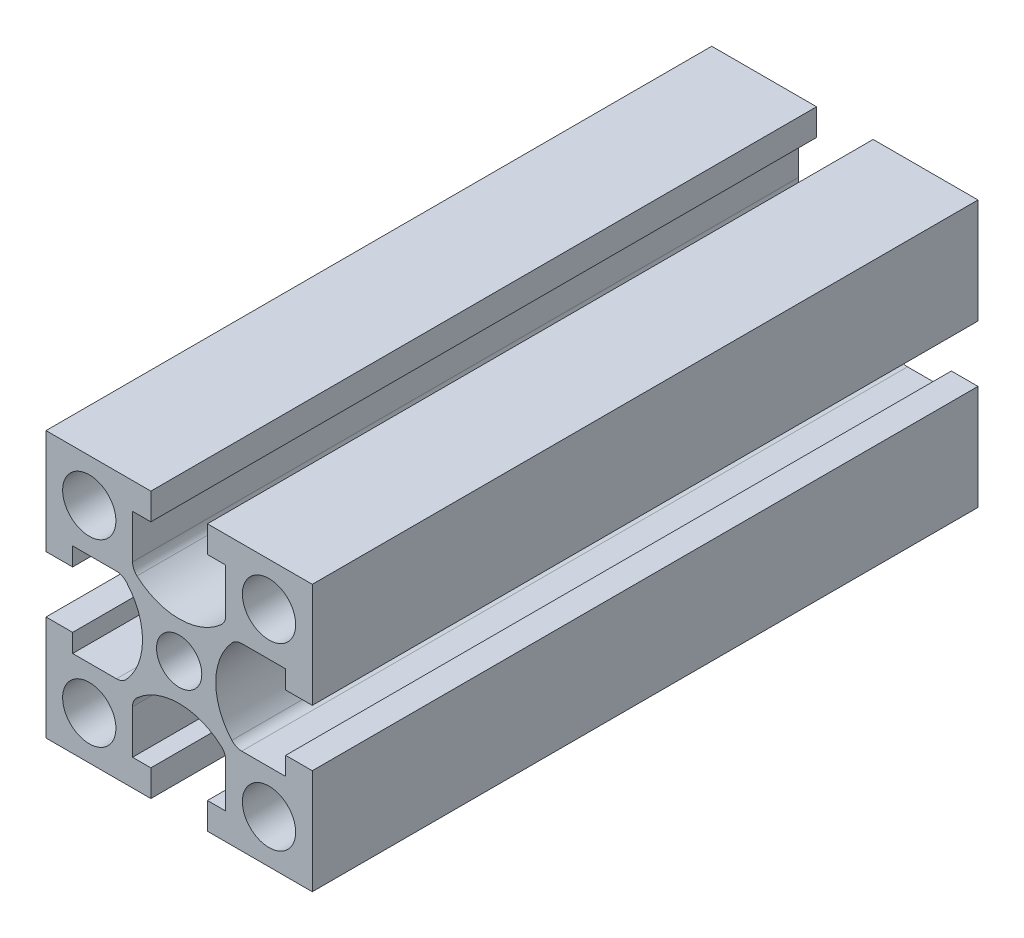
ISO-10303-21;
HEADER;
FILE_DESCRIPTION(('STEP AP214'),'2;1');
FILE_NAME('part.step','',(''),(''),'','','');
FILE_SCHEMA(('AUTOMOTIVE_DESIGN { 1 0 10303 214 1 1 1 1 }'));
ENDSEC;
DATA;
#1=APPLICATION_CONTEXT('core data for automotive mechanical design processes');
#2=APPLICATION_PROTOCOL_DEFINITION('international standard','automotive_design',2000,#1);
#3=PRODUCT_CONTEXT('',#1,'mechanical');
#4=PRODUCT('Part','Part','',(#3));
#5=PRODUCT_RELATED_PRODUCT_CATEGORY('part','',(#4));
#6=PRODUCT_DEFINITION_FORMATION('','',#4);
#7=PRODUCT_DEFINITION_CONTEXT('part definition',#1,'design');
#8=PRODUCT_DEFINITION('design','',#6,#7);
#9=PRODUCT_DEFINITION_SHAPE('','',#8);
#10=(LENGTH_UNIT() NAMED_UNIT(*) SI_UNIT(.MILLI.,.METRE.));
#11=(NAMED_UNIT(*) PLANE_ANGLE_UNIT() SI_UNIT($,.RADIAN.));
#12=(NAMED_UNIT(*) SI_UNIT($,.STERADIAN.) SOLID_ANGLE_UNIT());
#13=UNCERTAINTY_MEASURE_WITH_UNIT(LENGTH_MEASURE(1.E-05),#10,'distance_accuracy_value','');
#14=(GEOMETRIC_REPRESENTATION_CONTEXT(3) GLOBAL_UNCERTAINTY_ASSIGNED_CONTEXT((#13)) GLOBAL_UNIT_ASSIGNED_CONTEXT((#10,
#11,#12)) REPRESENTATION_CONTEXT('',''));
#15=CARTESIAN_POINT('',(0.,0.,0.));
#16=DIRECTION('',(0.,0.,1.));
#17=DIRECTION('',(1.,0.,0.));
#18=AXIS2_PLACEMENT_3D('',#15,#16,#17);
#19=CARTESIAN_POINT('',(20.,20.,50.));
#20=DIRECTION('',(-1.,0.,0.));
#21=DIRECTION('',(0.,0.,1.));
#22=AXIS2_PLACEMENT_3D('',#19,#20,#21);
#23=PLANE('',#22);
#24=DIRECTION('',(0.,1.,0.));
#25=VECTOR('',#24,1.);
#26=CARTESIAN_POINT('',(20.,20.,50.));
#27=LINE('',#26,#25);
#28=CARTESIAN_POINT('',(20.,4.25000000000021,50.));
#29=VERTEX_POINT('',#28);
#30=CARTESIAN_POINT('',(20.,20.,50.));
#31=VERTEX_POINT('',#30);
#32=EDGE_CURVE('E656',#29,#31,#27,.T.);
#33=ORIENTED_EDGE('',*,*,#32,.F.);
#34=DIRECTION('',(0.,0.,1.));
#35=VECTOR('',#34,1.);
#36=CARTESIAN_POINT('',(20.,4.25000000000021,-50.));
#37=LINE('',#36,#35);
#38=CARTESIAN_POINT('',(20.,4.25000000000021,-50.));
#39=VERTEX_POINT('',#38);
#40=EDGE_CURVE('E384',#39,#29,#37,.T.);
#41=ORIENTED_EDGE('',*,*,#40,.F.);
#42=DIRECTION('',(0.,1.,0.));
#43=VECTOR('',#42,1.);
#44=CARTESIAN_POINT('',(20.,20.,-50.));
#45=LINE('',#44,#43);
#46=CARTESIAN_POINT('',(20.,20.,-50.));
#47=VERTEX_POINT('',#46);
#48=EDGE_CURVE('E340',#39,#47,#45,.T.);
#49=ORIENTED_EDGE('',*,*,#48,.T.);
#50=DIRECTION('',(0.,0.,-1.));
#51=VECTOR('',#50,1.);
#52=CARTESIAN_POINT('',(20.,20.,50.));
#53=LINE('',#52,#51);
#54=EDGE_CURVE('E11',#31,#47,#53,.T.);
#55=ORIENTED_EDGE('',*,*,#54,.F.);
#56=EDGE_LOOP('',(#33,#41,#49,#55));
#57=FACE_BOUND('',#56,.T.);
#58=ADVANCED_FACE('F37',(#57),#23,.F.);
#59=CARTESIAN_POINT('',(-20.,-20.,50.));
#60=DIRECTION('',(0.,1.,0.));
#61=DIRECTION('',(0.,0.,1.));
#62=AXIS2_PLACEMENT_3D('',#59,#60,#61);
#63=PLANE('',#62);
#64=DIRECTION('',(1.,0.,0.));
#65=VECTOR('',#64,1.);
#66=CARTESIAN_POINT('',(-20.,-20.,50.));
#67=LINE('',#66,#65);
#68=CARTESIAN_POINT('',(4.25,-20.,50.));
#69=VERTEX_POINT('',#68);
#70=CARTESIAN_POINT('',(20.,-20.,50.));
#71=VERTEX_POINT('',#70);
#72=EDGE_CURVE('E664',#69,#71,#67,.T.);
#73=ORIENTED_EDGE('',*,*,#72,.F.);
#74=DIRECTION('',(0.,0.,1.));
#75=VECTOR('',#74,1.);
#76=CARTESIAN_POINT('',(4.25,-20.,-50.));
#77=LINE('',#76,#75);
#78=CARTESIAN_POINT('',(4.25,-20.,-50.));
#79=VERTEX_POINT('',#78);
#80=EDGE_CURVE('E454',#79,#69,#77,.T.);
#81=ORIENTED_EDGE('',*,*,#80,.F.);
#82=DIRECTION('',(1.,0.,0.));
#83=VECTOR('',#82,1.);
#84=CARTESIAN_POINT('',(-20.,-20.,-50.));
#85=LINE('',#84,#83);
#86=CARTESIAN_POINT('',(20.,-20.,-50.));
#87=VERTEX_POINT('',#86);
#88=EDGE_CURVE('E680',#79,#87,#85,.T.);
#89=ORIENTED_EDGE('',*,*,#88,.T.);
#90=DIRECTION('',(0.,0.,-1.));
#91=VECTOR('',#90,1.);
#92=CARTESIAN_POINT('',(20.,-20.,50.));
#93=LINE('',#92,#91);
#94=EDGE_CURVE('E668',#71,#87,#93,.T.);
#95=ORIENTED_EDGE('',*,*,#94,.F.);
#96=EDGE_LOOP('',(#73,#81,#89,#95));
#97=FACE_BOUND('',#96,.T.);
#98=ADVANCED_FACE('F750',(#97),#63,.F.);
#99=CARTESIAN_POINT('',(-20.,20.,50.));
#100=DIRECTION('',(1.,0.,0.));
#101=DIRECTION('',(0.,1.,0.));
#102=AXIS2_PLACEMENT_3D('',#99,#100,#101);
#103=PLANE('',#102);
#104=DIRECTION('',(0.,-1.,0.));
#105=VECTOR('',#104,1.);
#106=CARTESIAN_POINT('',(-20.,20.,50.));
#107=LINE('',#106,#105);
#108=CARTESIAN_POINT('',(-20.,-4.25000000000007,50.));
#109=VERTEX_POINT('',#108);
#110=CARTESIAN_POINT('',(-20.,-20.,50.));
#111=VERTEX_POINT('',#110);
#112=EDGE_CURVE('E660',#109,#111,#107,.T.);
#113=ORIENTED_EDGE('',*,*,#112,.F.);
#114=DIRECTION('',(0.,0.,1.));
#115=VECTOR('',#114,1.);
#116=CARTESIAN_POINT('',(-20.,-4.25000000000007,-50.));
#117=LINE('',#116,#115);
#118=CARTESIAN_POINT('',(-20.,-4.25000000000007,-50.));
#119=VERTEX_POINT('',#118);
#120=EDGE_CURVE('E528',#119,#109,#117,.T.);
#121=ORIENTED_EDGE('',*,*,#120,.F.);
#122=DIRECTION('',(0.,-1.,0.));
#123=VECTOR('',#122,1.);
#124=CARTESIAN_POINT('',(-20.,20.,-50.));
#125=LINE('',#124,#123);
#126=CARTESIAN_POINT('',(-20.,-20.,-50.));
#127=VERTEX_POINT('',#126);
#128=EDGE_CURVE('E676',#119,#127,#125,.T.);
#129=ORIENTED_EDGE('',*,*,#128,.T.);
#130=DIRECTION('',(0.,0.,-1.));
#131=VECTOR('',#130,1.);
#132=CARTESIAN_POINT('',(-20.,-20.,50.));
#133=LINE('',#132,#131);
#134=EDGE_CURVE('E686',#111,#127,#133,.T.);
#135=ORIENTED_EDGE('',*,*,#134,.F.);
#136=EDGE_LOOP('',(#113,#121,#129,#135));
#137=FACE_BOUND('',#136,.T.);
#138=ADVANCED_FACE('F754',(#137),#103,.F.);
#139=CARTESIAN_POINT('',(-20.,20.,50.));
#140=DIRECTION('',(0.,-1.,0.));
#141=DIRECTION('',(0.,0.,-1.));
#142=AXIS2_PLACEMENT_3D('',#139,#140,#141);
#143=PLANE('',#142);
#144=DIRECTION('',(-1.,0.,0.));
#145=VECTOR('',#144,1.);
#146=CARTESIAN_POINT('',(-20.,20.,50.));
#147=LINE('',#146,#145);
#148=CARTESIAN_POINT('',(-4.25,20.,50.));
#149=VERTEX_POINT('',#148);
#150=CARTESIAN_POINT('',(-20.,20.,50.));
#151=VERTEX_POINT('',#150);
#152=EDGE_CURVE('E655',#149,#151,#147,.T.);
#153=ORIENTED_EDGE('',*,*,#152,.F.);
#154=DIRECTION('',(0.,0.,1.));
#155=VECTOR('',#154,1.);
#156=CARTESIAN_POINT('',(-4.25,20.,-50.));
#157=LINE('',#156,#155);
#158=CARTESIAN_POINT('',(-4.25,20.,-50.));
#159=VERTEX_POINT('',#158);
#160=EDGE_CURVE('E602',#159,#149,#157,.T.);
#161=ORIENTED_EDGE('',*,*,#160,.F.);
#162=DIRECTION('',(-1.,0.,0.));
#163=VECTOR('',#162,1.);
#164=CARTESIAN_POINT('',(-20.,20.,-50.));
#165=LINE('',#164,#163);
#166=CARTESIAN_POINT('',(-20.,20.,-50.));
#167=VERTEX_POINT('',#166);
#168=EDGE_CURVE('E672',#159,#167,#165,.T.);
#169=ORIENTED_EDGE('',*,*,#168,.T.);
#170=DIRECTION('',(0.,0.,-1.));
#171=VECTOR('',#170,1.);
#172=CARTESIAN_POINT('',(-20.,20.,50.));
#173=LINE('',#172,#171);
#174=EDGE_CURVE('E45',#151,#167,#173,.T.);
#175=ORIENTED_EDGE('',*,*,#174,.F.);
#176=EDGE_LOOP('',(#153,#161,#169,#175));
#177=FACE_BOUND('',#176,.T.);
#178=ADVANCED_FACE('F709',(#177),#143,.F.);
#179=CARTESIAN_POINT('',(20.,-4.24999999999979,-50.));
#180=VERTEX_POINT('',#179);
#181=EDGE_CURVE('E669',#87,#180,#45,.T.);
#182=ORIENTED_EDGE('',*,*,#181,.T.);
#183=DIRECTION('',(0.,0.,1.));
#184=VECTOR('',#183,1.);
#185=CARTESIAN_POINT('',(20.,-4.24999999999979,-50.));
#186=LINE('',#185,#184);
#187=CARTESIAN_POINT('',(20.,-4.24999999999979,50.));
#188=VERTEX_POINT('',#187);
#189=EDGE_CURVE('E387',#180,#188,#186,.T.);
#190=ORIENTED_EDGE('',*,*,#189,.T.);
#191=EDGE_CURVE('E652',#71,#188,#27,.T.);
#192=ORIENTED_EDGE('',*,*,#191,.F.);
#193=ORIENTED_EDGE('',*,*,#94,.T.);
#194=EDGE_LOOP('',(#182,#190,#192,#193));
#195=FACE_BOUND('',#194,.T.);
#196=ADVANCED_FACE('F39',(#195),#23,.F.);
#197=CARTESIAN_POINT('',(4.25,20.,-50.));
#198=VERTEX_POINT('',#197);
#199=EDGE_CURVE('E673',#47,#198,#165,.T.);
#200=ORIENTED_EDGE('',*,*,#199,.T.);
#201=DIRECTION('',(0.,0.,1.));
#202=VECTOR('',#201,1.);
#203=CARTESIAN_POINT('',(4.25,20.,-50.));
#204=LINE('',#203,#202);
#205=CARTESIAN_POINT('',(4.25,20.,50.));
#206=VERTEX_POINT('',#205);
#207=EDGE_CURVE('E605',#198,#206,#204,.T.);
#208=ORIENTED_EDGE('',*,*,#207,.T.);
#209=EDGE_CURVE('E657',#31,#206,#147,.T.);
#210=ORIENTED_EDGE('',*,*,#209,.F.);
#211=ORIENTED_EDGE('',*,*,#54,.T.);
#212=EDGE_LOOP('',(#200,#208,#210,#211));
#213=FACE_BOUND('',#212,.T.);
#214=ADVANCED_FACE('F745',(#213),#143,.F.);
#215=CARTESIAN_POINT('',(-20.,4.24999999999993,-50.));
#216=VERTEX_POINT('',#215);
#217=EDGE_CURVE('E677',#167,#216,#125,.T.);
#218=ORIENTED_EDGE('',*,*,#217,.T.);
#219=DIRECTION('',(0.,0.,1.));
#220=VECTOR('',#219,1.);
#221=CARTESIAN_POINT('',(-20.,4.24999999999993,-50.));
#222=LINE('',#221,#220);
#223=CARTESIAN_POINT('',(-20.,4.24999999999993,50.));
#224=VERTEX_POINT('',#223);
#225=EDGE_CURVE('E531',#216,#224,#222,.T.);
#226=ORIENTED_EDGE('',*,*,#225,.T.);
#227=EDGE_CURVE('E661',#151,#224,#107,.T.);
#228=ORIENTED_EDGE('',*,*,#227,.F.);
#229=ORIENTED_EDGE('',*,*,#174,.T.);
#230=EDGE_LOOP('',(#218,#226,#228,#229));
#231=FACE_BOUND('',#230,.T.);
#232=ADVANCED_FACE('F693',(#231),#103,.F.);
#233=CARTESIAN_POINT('',(-4.25,-20.,-50.));
#234=VERTEX_POINT('',#233);
#235=EDGE_CURVE('E681',#127,#234,#85,.T.);
#236=ORIENTED_EDGE('',*,*,#235,.T.);
#237=DIRECTION('',(0.,0.,1.));
#238=VECTOR('',#237,1.);
#239=CARTESIAN_POINT('',(-4.25,-20.,-50.));
#240=LINE('',#239,#238);
#241=CARTESIAN_POINT('',(-4.25,-20.,50.));
#242=VERTEX_POINT('',#241);
#243=EDGE_CURVE('E457',#234,#242,#240,.T.);
#244=ORIENTED_EDGE('',*,*,#243,.T.);
#245=EDGE_CURVE('E665',#111,#242,#67,.T.);
#246=ORIENTED_EDGE('',*,*,#245,.F.);
#247=ORIENTED_EDGE('',*,*,#134,.T.);
#248=EDGE_LOOP('',(#236,#244,#246,#247));
#249=FACE_BOUND('',#248,.T.);
#250=ADVANCED_FACE('F757',(#249),#63,.F.);
#251=CARTESIAN_POINT('',(20.,-20.,50.));
#252=DIRECTION('',(0.,0.,1.));
#253=DIRECTION('',(1.,0.,0.));
#254=AXIS2_PLACEMENT_3D('',#251,#252,#253);
#255=PLANE('',#254);
#256=DIRECTION('',(-1.,0.,0.));
#257=VECTOR('',#256,1.);
#258=CARTESIAN_POINT('',(20.,4.25000000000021,50.));
#259=LINE('',#258,#257);
#260=CARTESIAN_POINT('',(16.,4.25000000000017,50.));
#261=VERTEX_POINT('',#260);
#262=EDGE_CURVE('E324',#29,#261,#259,.T.);
#263=ORIENTED_EDGE('',*,*,#262,.F.);
#264=ORIENTED_EDGE('',*,*,#32,.T.);
#265=ORIENTED_EDGE('',*,*,#209,.T.);
#266=DIRECTION('',(0.,1.,0.));
#267=VECTOR('',#266,1.);
#268=CARTESIAN_POINT('',(4.25,20.,50.));
#269=LINE('',#268,#267);
#270=CARTESIAN_POINT('',(4.25,16.,50.));
#271=VERTEX_POINT('',#270);
#272=EDGE_CURVE('E553',#271,#206,#269,.T.);
#273=ORIENTED_EDGE('',*,*,#272,.F.);
#274=DIRECTION('',(-1.,0.,0.));
#275=VECTOR('',#274,1.);
#276=CARTESIAN_POINT('',(4.25,16.,50.));
#277=LINE('',#276,#275);
#278=CARTESIAN_POINT('',(7.,16.,50.));
#279=VERTEX_POINT('',#278);
#280=EDGE_CURVE('E598',#279,#271,#277,.T.);
#281=ORIENTED_EDGE('',*,*,#280,.F.);
#282=DIRECTION('',(0.,1.,0.));
#283=VECTOR('',#282,1.);
#284=CARTESIAN_POINT('',(7.,16.,50.));
#285=LINE('',#284,#283);
#286=CARTESIAN_POINT('',(7.,9.40983005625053,50.));
#287=VERTEX_POINT('',#286);
#288=EDGE_CURVE('E595',#287,#279,#285,.T.);
#289=ORIENTED_EDGE('',*,*,#288,.F.);
#290=CARTESIAN_POINT('',(5.,9.40983005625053,50.));
#291=DIRECTION('',(0.,0.,1.));
#292=DIRECTION('',(-1.,0.,0.));
#293=AXIS2_PLACEMENT_3D('',#290,#291,#292);
#294=CIRCLE('',#293,2.);
#295=CARTESIAN_POINT('',(6.33333333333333,7.91911807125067,50.));
#296=VERTEX_POINT('',#295);
#297=EDGE_CURVE('E592',#296,#287,#294,.T.);
#298=ORIENTED_EDGE('',*,*,#297,.F.);
#299=CARTESIAN_POINT('',(0.,15.,50.));
#300=DIRECTION('',(0.,0.,1.));
#301=DIRECTION('',(1.,0.,0.));
#302=AXIS2_PLACEMENT_3D('',#299,#300,#301);
#303=CIRCLE('',#302,9.5);
#304=CARTESIAN_POINT('',(-6.33333333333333,7.91911807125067,50.));
#305=VERTEX_POINT('',#304);
#306=EDGE_CURVE('E589',#305,#296,#303,.T.);
#307=ORIENTED_EDGE('',*,*,#306,.F.);
#308=CARTESIAN_POINT('',(-5.,9.40983005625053,50.));
#309=DIRECTION('',(0.,0.,1.));
#310=DIRECTION('',(1.,0.,0.));
#311=AXIS2_PLACEMENT_3D('',#308,#309,#310);
#312=CIRCLE('',#311,2.);
#313=CARTESIAN_POINT('',(-7.,9.40983005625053,50.));
#314=VERTEX_POINT('',#313);
#315=EDGE_CURVE('E586',#314,#305,#312,.T.);
#316=ORIENTED_EDGE('',*,*,#315,.F.);
#317=DIRECTION('',(0.,-1.,0.));
#318=VECTOR('',#317,1.);
#319=CARTESIAN_POINT('',(-7.,16.,50.));
#320=LINE('',#319,#318);
#321=CARTESIAN_POINT('',(-7.,16.,50.));
#322=VERTEX_POINT('',#321);
#323=EDGE_CURVE('E583',#322,#314,#320,.T.);
#324=ORIENTED_EDGE('',*,*,#323,.F.);
#325=DIRECTION('',(-1.,0.,0.));
#326=VECTOR('',#325,1.);
#327=CARTESIAN_POINT('',(-4.25,16.,50.));
#328=LINE('',#327,#326);
#329=CARTESIAN_POINT('',(-4.25,16.,50.));
#330=VERTEX_POINT('',#329);
#331=EDGE_CURVE('E580',#330,#322,#328,.T.);
#332=ORIENTED_EDGE('',*,*,#331,.F.);
#333=DIRECTION('',(0.,-1.,0.));
#334=VECTOR('',#333,1.);
#335=CARTESIAN_POINT('',(-4.25,20.,50.));
#336=LINE('',#335,#334);
#337=EDGE_CURVE('E530',#149,#330,#336,.T.);
#338=ORIENTED_EDGE('',*,*,#337,.F.);
#339=ORIENTED_EDGE('',*,*,#152,.T.);
#340=ORIENTED_EDGE('',*,*,#227,.T.);
#341=DIRECTION('',(-1.,0.,0.));
#342=VECTOR('',#341,1.);
#343=CARTESIAN_POINT('',(-20.,4.24999999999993,50.));
#344=LINE('',#343,#342);
#345=CARTESIAN_POINT('',(-16.,4.24999999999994,50.));
#346=VERTEX_POINT('',#345);
#347=EDGE_CURVE('E479',#346,#224,#344,.T.);
#348=ORIENTED_EDGE('',*,*,#347,.F.);
#349=DIRECTION('',(0.,-1.,0.));
#350=VECTOR('',#349,1.);
#351=CARTESIAN_POINT('',(-16.,4.24999999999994,50.));
#352=LINE('',#351,#350);
#353=CARTESIAN_POINT('',(-16.,6.99999999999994,50.));
#354=VERTEX_POINT('',#353);
#355=EDGE_CURVE('E524',#354,#346,#352,.T.);
#356=ORIENTED_EDGE('',*,*,#355,.F.);
#357=DIRECTION('',(-1.,0.,0.));
#358=VECTOR('',#357,1.);
#359=CARTESIAN_POINT('',(-16.,6.99999999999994,50.));
#360=LINE('',#359,#358);
#361=CARTESIAN_POINT('',(-9.40983005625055,6.99999999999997,50.));
#362=VERTEX_POINT('',#361);
#363=EDGE_CURVE('E521',#362,#354,#360,.T.);
#364=ORIENTED_EDGE('',*,*,#363,.F.);
#365=CARTESIAN_POINT('',(-9.40983005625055,4.99999999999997,50.));
#366=DIRECTION('',(0.,0.,1.));
#367=DIRECTION('',(0.,-1.,0.));
#368=AXIS2_PLACEMENT_3D('',#365,#366,#367);
#369=CIRCLE('',#368,2.);
#370=CARTESIAN_POINT('',(-7.91911807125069,6.3333333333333,50.));
#371=VERTEX_POINT('',#370);
#372=EDGE_CURVE('E518',#371,#362,#369,.T.);
#373=ORIENTED_EDGE('',*,*,#372,.F.);
#374=CARTESIAN_POINT('',(-15.,0.,50.));
#375=DIRECTION('',(0.,0.,1.));
#376=DIRECTION('',(0.,1.,0.));
#377=AXIS2_PLACEMENT_3D('',#374,#375,#376);
#378=CIRCLE('',#377,9.5);
#379=CARTESIAN_POINT('',(-7.91911807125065,-6.33333333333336,50.));
#380=VERTEX_POINT('',#379);
#381=EDGE_CURVE('E515',#380,#371,#378,.T.);
#382=ORIENTED_EDGE('',*,*,#381,.F.);
#383=CARTESIAN_POINT('',(-9.40983005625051,-5.00000000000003,50.));
#384=DIRECTION('',(0.,0.,1.));
#385=DIRECTION('',(0.,1.,0.));
#386=AXIS2_PLACEMENT_3D('',#383,#384,#385);
#387=CIRCLE('',#386,2.);
#388=CARTESIAN_POINT('',(-9.40983005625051,-7.00000000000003,50.));
#389=VERTEX_POINT('',#388);
#390=EDGE_CURVE('E512',#389,#380,#387,.T.);
#391=ORIENTED_EDGE('',*,*,#390,.F.);
#392=DIRECTION('',(1.,0.,0.));
#393=VECTOR('',#392,1.);
#394=CARTESIAN_POINT('',(-16.,-7.00000000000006,50.));
#395=LINE('',#394,#393);
#396=CARTESIAN_POINT('',(-16.,-7.00000000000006,50.));
#397=VERTEX_POINT('',#396);
#398=EDGE_CURVE('E509',#397,#389,#395,.T.);
#399=ORIENTED_EDGE('',*,*,#398,.F.);
#400=DIRECTION('',(0.,-1.,0.));
#401=VECTOR('',#400,1.);
#402=CARTESIAN_POINT('',(-16.,-4.25000000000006,50.));
#403=LINE('',#402,#401);
#404=CARTESIAN_POINT('',(-16.,-4.25000000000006,50.));
#405=VERTEX_POINT('',#404);
#406=EDGE_CURVE('E506',#405,#397,#403,.T.);
#407=ORIENTED_EDGE('',*,*,#406,.F.);
#408=DIRECTION('',(1.,0.,0.));
#409=VECTOR('',#408,1.);
#410=CARTESIAN_POINT('',(-20.,-4.25000000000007,50.));
#411=LINE('',#410,#409);
#412=EDGE_CURVE('E456',#109,#405,#411,.T.);
#413=ORIENTED_EDGE('',*,*,#412,.F.);
#414=ORIENTED_EDGE('',*,*,#112,.T.);
#415=ORIENTED_EDGE('',*,*,#245,.T.);
#416=DIRECTION('',(0.,-1.,0.));
#417=VECTOR('',#416,1.);
#418=CARTESIAN_POINT('',(-4.25,-20.,50.));
#419=LINE('',#418,#417);
#420=CARTESIAN_POINT('',(-4.25,-16.,50.));
#421=VERTEX_POINT('',#420);
#422=EDGE_CURVE('E407',#421,#242,#419,.T.);
#423=ORIENTED_EDGE('',*,*,#422,.F.);
#424=DIRECTION('',(1.,0.,0.));
#425=VECTOR('',#424,1.);
#426=CARTESIAN_POINT('',(-4.25,-16.,50.));
#427=LINE('',#426,#425);
#428=CARTESIAN_POINT('',(-7.,-16.,50.));
#429=VERTEX_POINT('',#428);
#430=EDGE_CURVE('E450',#429,#421,#427,.T.);
#431=ORIENTED_EDGE('',*,*,#430,.F.);
#432=DIRECTION('',(0.,-1.,0.));
#433=VECTOR('',#432,1.);
#434=CARTESIAN_POINT('',(-7.,-16.,50.));
#435=LINE('',#434,#433);
#436=CARTESIAN_POINT('',(-7.,-9.40983005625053,50.));
#437=VERTEX_POINT('',#436);
#438=EDGE_CURVE('E447',#437,#429,#435,.T.);
#439=ORIENTED_EDGE('',*,*,#438,.F.);
#440=CARTESIAN_POINT('',(-5.,-9.40983005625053,50.));
#441=DIRECTION('',(0.,0.,1.));
#442=DIRECTION('',(1.,0.,0.));
#443=AXIS2_PLACEMENT_3D('',#440,#441,#442);
#444=CIRCLE('',#443,2.);
#445=CARTESIAN_POINT('',(-6.33333333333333,-7.91911807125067,50.));
#446=VERTEX_POINT('',#445);
#447=EDGE_CURVE('E444',#446,#437,#444,.T.);
#448=ORIENTED_EDGE('',*,*,#447,.F.);
#449=CARTESIAN_POINT('',(0.,-15.,50.));
#450=DIRECTION('',(0.,0.,1.));
#451=DIRECTION('',(-1.,0.,0.));
#452=AXIS2_PLACEMENT_3D('',#449,#450,#451);
#453=CIRCLE('',#452,9.5);
#454=CARTESIAN_POINT('',(6.33333333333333,-7.91911807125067,50.));
#455=VERTEX_POINT('',#454);
#456=EDGE_CURVE('E441',#455,#446,#453,.T.);
#457=ORIENTED_EDGE('',*,*,#456,.F.);
#458=CARTESIAN_POINT('',(5.,-9.40983005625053,50.));
#459=DIRECTION('',(0.,0.,1.));
#460=DIRECTION('',(-1.,0.,0.));
#461=AXIS2_PLACEMENT_3D('',#458,#459,#460);
#462=CIRCLE('',#461,2.);
#463=CARTESIAN_POINT('',(7.,-9.40983005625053,50.));
#464=VERTEX_POINT('',#463);
#465=EDGE_CURVE('E438',#464,#455,#462,.T.);
#466=ORIENTED_EDGE('',*,*,#465,.F.);
#467=DIRECTION('',(0.,1.,0.));
#468=VECTOR('',#467,1.);
#469=CARTESIAN_POINT('',(7.,-16.,50.));
#470=LINE('',#469,#468);
#471=CARTESIAN_POINT('',(7.,-16.,50.));
#472=VERTEX_POINT('',#471);
#473=EDGE_CURVE('E435',#472,#464,#470,.T.);
#474=ORIENTED_EDGE('',*,*,#473,.F.);
#475=DIRECTION('',(1.,0.,0.));
#476=VECTOR('',#475,1.);
#477=CARTESIAN_POINT('',(4.25,-16.,50.));
#478=LINE('',#477,#476);
#479=CARTESIAN_POINT('',(4.25,-16.,50.));
#480=VERTEX_POINT('',#479);
#481=EDGE_CURVE('E432',#480,#472,#478,.T.);
#482=ORIENTED_EDGE('',*,*,#481,.F.);
#483=DIRECTION('',(0.,1.,0.));
#484=VECTOR('',#483,1.);
#485=CARTESIAN_POINT('',(4.25,-20.,50.));
#486=LINE('',#485,#484);
#487=EDGE_CURVE('E386',#69,#480,#486,.T.);
#488=ORIENTED_EDGE('',*,*,#487,.F.);
#489=ORIENTED_EDGE('',*,*,#72,.T.);
#490=ORIENTED_EDGE('',*,*,#191,.T.);
#491=DIRECTION('',(1.,0.,0.));
#492=VECTOR('',#491,1.);
#493=CARTESIAN_POINT('',(20.,-4.24999999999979,50.));
#494=LINE('',#493,#492);
#495=CARTESIAN_POINT('',(16.,-4.24999999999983,50.));
#496=VERTEX_POINT('',#495);
#497=EDGE_CURVE('E341',#496,#188,#494,.T.);
#498=ORIENTED_EDGE('',*,*,#497,.F.);
#499=DIRECTION('',(0.,1.,0.));
#500=VECTOR('',#499,1.);
#501=CARTESIAN_POINT('',(16.,-4.24999999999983,50.));
#502=LINE('',#501,#500);
#503=CARTESIAN_POINT('',(16.0000000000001,-6.99999999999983,50.));
#504=VERTEX_POINT('',#503);
#505=EDGE_CURVE('E343',#504,#496,#502,.T.);
#506=ORIENTED_EDGE('',*,*,#505,.F.);
#507=DIRECTION('',(1.,0.,0.));
#508=VECTOR('',#507,1.);
#509=CARTESIAN_POINT('',(16.0000000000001,-6.99999999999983,50.));
#510=LINE('',#509,#508);
#511=CARTESIAN_POINT('',(9.4098300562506,-6.9999999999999,50.));
#512=VERTEX_POINT('',#511);
#513=EDGE_CURVE('E379',#512,#504,#510,.T.);
#514=ORIENTED_EDGE('',*,*,#513,.F.);
#515=CARTESIAN_POINT('',(9.40983005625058,-4.9999999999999,50.));
#516=DIRECTION('',(0.,0.,1.));
#517=DIRECTION('',(0.,1.,0.));
#518=AXIS2_PLACEMENT_3D('',#515,#516,#517);
#519=CIRCLE('',#518,2.);
#520=CARTESIAN_POINT('',(7.91911807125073,-6.33333333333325,50.));
#521=VERTEX_POINT('',#520);
#522=EDGE_CURVE('E376',#521,#512,#519,.T.);
#523=ORIENTED_EDGE('',*,*,#522,.F.);
#524=CARTESIAN_POINT('',(15.,1.57116660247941E-13,50.));
#525=DIRECTION('',(0.,0.,1.));
#526=DIRECTION('',(0.,-1.,0.));
#527=AXIS2_PLACEMENT_3D('',#524,#525,#526);
#528=CIRCLE('',#527,9.5);
#529=CARTESIAN_POINT('',(7.91911807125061,6.33333333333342,50.));
#530=VERTEX_POINT('',#529);
#531=EDGE_CURVE('E373',#530,#521,#528,.T.);
#532=ORIENTED_EDGE('',*,*,#531,.F.);
#533=CARTESIAN_POINT('',(9.40983005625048,5.0000000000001,50.));
#534=DIRECTION('',(0.,0.,1.));
#535=DIRECTION('',(0.,-1.,0.));
#536=AXIS2_PLACEMENT_3D('',#533,#534,#535);
#537=CIRCLE('',#536,2.);
#538=CARTESIAN_POINT('',(9.40983005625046,7.0000000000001,50.));
#539=VERTEX_POINT('',#538);
#540=EDGE_CURVE('E370',#539,#530,#537,.T.);
#541=ORIENTED_EDGE('',*,*,#540,.F.);
#542=DIRECTION('',(-1.,0.,0.));
#543=VECTOR('',#542,1.);
#544=CARTESIAN_POINT('',(15.9999999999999,7.00000000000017,50.));
#545=LINE('',#544,#543);
#546=CARTESIAN_POINT('',(15.9999999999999,7.00000000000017,50.));
#547=VERTEX_POINT('',#546);
#548=EDGE_CURVE('E367',#547,#539,#545,.T.);
#549=ORIENTED_EDGE('',*,*,#548,.F.);
#550=DIRECTION('',(0.,1.,0.));
#551=VECTOR('',#550,1.);
#552=CARTESIAN_POINT('',(16.,4.25000000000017,50.));
#553=LINE('',#552,#551);
#554=EDGE_CURVE('E365',#261,#547,#553,.T.);
#555=ORIENTED_EDGE('',*,*,#554,.F.);
#556=EDGE_LOOP('',(#263,#264,#265,#273,#281,#289,#298,#307,#316,#324,#332,#338,#339,#340,#348,
#356,#364,#373,#382,#391,#399,#407,#413,#414,#415,#423,#431,#439,#448,#457,#466,#474,#482,#488,
#489,#490,#498,#506,#514,#523,#532,#541,#549,#555));
#557=FACE_BOUND('',#556,.T.);
#558=CARTESIAN_POINT('',(13.4999999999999,13.5000000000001,50.));
#559=DIRECTION('',(0.,0.,1.));
#560=DIRECTION('',(0.,-1.,0.));
#561=AXIS2_PLACEMENT_3D('',#558,#559,#560);
#562=CIRCLE('',#561,4.);
#563=CARTESIAN_POINT('',(13.4999999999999,9.50000000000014,50.));
#564=VERTEX_POINT('',#563);
#565=EDGE_CURVE('E604',#564,#564,#562,.T.);
#566=ORIENTED_EDGE('',*,*,#565,.F.);
#567=EDGE_LOOP('',(#566));
#568=FACE_BOUND('',#567,.T.);
#569=CARTESIAN_POINT('',(13.5,-13.5,50.));
#570=DIRECTION('',(0.,0.,1.));
#571=DIRECTION('',(-1.,0.,0.));
#572=AXIS2_PLACEMENT_3D('',#569,#570,#571);
#573=CIRCLE('',#572,4.);
#574=CARTESIAN_POINT('',(9.5,-13.5,50.));
#575=VERTEX_POINT('',#574);
#576=EDGE_CURVE('E626',#575,#575,#573,.T.);
#577=ORIENTED_EDGE('',*,*,#576,.F.);
#578=EDGE_LOOP('',(#577));
#579=FACE_BOUND('',#578,.T.);
#580=CARTESIAN_POINT('',(-13.5,-13.5,50.));
#581=DIRECTION('',(0.,0.,1.));
#582=DIRECTION('',(0.,1.,0.));
#583=AXIS2_PLACEMENT_3D('',#580,#581,#582);
#584=CIRCLE('',#583,4.);
#585=CARTESIAN_POINT('',(-13.5,-9.50000000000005,50.));
#586=VERTEX_POINT('',#585);
#587=EDGE_CURVE('E632',#586,#586,#584,.T.);
#588=ORIENTED_EDGE('',*,*,#587,.F.);
#589=EDGE_LOOP('',(#588));
#590=FACE_BOUND('',#589,.T.);
#591=CARTESIAN_POINT('',(-13.5,13.5,50.));
#592=DIRECTION('',(0.,0.,1.));
#593=DIRECTION('',(1.,0.,0.));
#594=AXIS2_PLACEMENT_3D('',#591,#592,#593);
#595=CIRCLE('',#594,4.);
#596=CARTESIAN_POINT('',(-9.5,13.5,50.));
#597=VERTEX_POINT('',#596);
#598=EDGE_CURVE('E638',#597,#597,#595,.T.);
#599=ORIENTED_EDGE('',*,*,#598,.F.);
#600=EDGE_LOOP('',(#599));
#601=FACE_BOUND('',#600,.T.);
#602=CARTESIAN_POINT('',(0.,0.,50.));
#603=DIRECTION('',(0.,0.,1.));
#604=DIRECTION('',(1.,0.,0.));
#605=AXIS2_PLACEMENT_3D('',#602,#603,#604);
#606=CIRCLE('',#605,3.4);
#607=CARTESIAN_POINT('',(3.4,0.,50.));
#608=VERTEX_POINT('',#607);
#609=EDGE_CURVE('E644',#608,#608,#606,.T.);
#610=ORIENTED_EDGE('',*,*,#609,.F.);
#611=EDGE_LOOP('',(#610));
#612=FACE_BOUND('',#611,.T.);
#613=ADVANCED_FACE('F703',(#557,#568,#579,#590,#601,#612),#255,.T.);
#614=CARTESIAN_POINT('',(20.,-20.,-50.));
#615=DIRECTION('',(0.,0.,1.));
#616=DIRECTION('',(1.,0.,0.));
#617=AXIS2_PLACEMENT_3D('',#614,#615,#616);
#618=PLANE('',#617);
#619=ORIENTED_EDGE('',*,*,#48,.F.);
#620=DIRECTION('',(-1.,0.,0.));
#621=VECTOR('',#620,1.);
#622=CARTESIAN_POINT('',(20.,4.25000000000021,-50.));
#623=LINE('',#622,#621);
#624=CARTESIAN_POINT('',(16.,4.25000000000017,-50.));
#625=VERTEX_POINT('',#624);
#626=EDGE_CURVE('E321',#39,#625,#623,.T.);
#627=ORIENTED_EDGE('',*,*,#626,.T.);
#628=DIRECTION('',(0.,1.,0.));
#629=VECTOR('',#628,1.);
#630=CARTESIAN_POINT('',(16.,4.25000000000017,-50.));
#631=LINE('',#630,#629);
#632=CARTESIAN_POINT('',(15.9999999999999,7.00000000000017,-50.));
#633=VERTEX_POINT('',#632);
#634=EDGE_CURVE('E332',#625,#633,#631,.T.);
#635=ORIENTED_EDGE('',*,*,#634,.T.);
#636=DIRECTION('',(-1.,0.,0.));
#637=VECTOR('',#636,1.);
#638=CARTESIAN_POINT('',(15.9999999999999,7.00000000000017,-50.));
#639=LINE('',#638,#637);
#640=CARTESIAN_POINT('',(9.40983005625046,7.0000000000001,-50.));
#641=VERTEX_POINT('',#640);
#642=EDGE_CURVE('E52',#633,#641,#639,.T.);
#643=ORIENTED_EDGE('',*,*,#642,.T.);
#644=CARTESIAN_POINT('',(9.40983005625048,5.0000000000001,-50.));
#645=DIRECTION('',(0.,0.,1.));
#646=DIRECTION('',(0.,-1.,0.));
#647=AXIS2_PLACEMENT_3D('',#644,#645,#646);
#648=CIRCLE('',#647,2.);
#649=CARTESIAN_POINT('',(7.91911807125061,6.33333333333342,-50.));
#650=VERTEX_POINT('',#649);
#651=EDGE_CURVE('E347',#641,#650,#648,.T.);
#652=ORIENTED_EDGE('',*,*,#651,.T.);
#653=CARTESIAN_POINT('',(15.,1.57116660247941E-13,-50.));
#654=DIRECTION('',(0.,0.,1.));
#655=DIRECTION('',(0.,-1.,0.));
#656=AXIS2_PLACEMENT_3D('',#653,#654,#655);
#657=CIRCLE('',#656,9.5);
#658=CARTESIAN_POINT('',(7.91911807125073,-6.33333333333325,-50.));
#659=VERTEX_POINT('',#658);
#660=EDGE_CURVE('E350',#650,#659,#657,.T.);
#661=ORIENTED_EDGE('',*,*,#660,.T.);
#662=CARTESIAN_POINT('',(9.40983005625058,-4.9999999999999,-50.));
#663=DIRECTION('',(0.,0.,1.));
#664=DIRECTION('',(0.,1.,0.));
#665=AXIS2_PLACEMENT_3D('',#662,#663,#664);
#666=CIRCLE('',#665,2.);
#667=CARTESIAN_POINT('',(9.4098300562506,-6.9999999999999,-50.));
#668=VERTEX_POINT('',#667);
#669=EDGE_CURVE('E353',#659,#668,#666,.T.);
#670=ORIENTED_EDGE('',*,*,#669,.T.);
#671=DIRECTION('',(1.,0.,0.));
#672=VECTOR('',#671,1.);
#673=CARTESIAN_POINT('',(16.0000000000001,-6.99999999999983,-50.));
#674=LINE('',#673,#672);
#675=CARTESIAN_POINT('',(16.0000000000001,-6.99999999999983,-50.));
#676=VERTEX_POINT('',#675);
#677=EDGE_CURVE('E356',#668,#676,#674,.T.);
#678=ORIENTED_EDGE('',*,*,#677,.T.);
#679=DIRECTION('',(0.,1.,0.));
#680=VECTOR('',#679,1.);
#681=CARTESIAN_POINT('',(16.,-4.24999999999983,-50.));
#682=LINE('',#681,#680);
#683=CARTESIAN_POINT('',(16.,-4.24999999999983,-50.));
#684=VERTEX_POINT('',#683);
#685=EDGE_CURVE('E359',#676,#684,#682,.T.);
#686=ORIENTED_EDGE('',*,*,#685,.T.);
#687=DIRECTION('',(1.,0.,0.));
#688=VECTOR('',#687,1.);
#689=CARTESIAN_POINT('',(20.,-4.24999999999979,-50.));
#690=LINE('',#689,#688);
#691=EDGE_CURVE('E329',#684,#180,#690,.T.);
#692=ORIENTED_EDGE('',*,*,#691,.T.);
#693=ORIENTED_EDGE('',*,*,#181,.F.);
#694=ORIENTED_EDGE('',*,*,#88,.F.);
#695=DIRECTION('',(0.,1.,0.));
#696=VECTOR('',#695,1.);
#697=CARTESIAN_POINT('',(4.25,-20.,-50.));
#698=LINE('',#697,#696);
#699=CARTESIAN_POINT('',(4.25,-16.,-50.));
#700=VERTEX_POINT('',#699);
#701=EDGE_CURVE('E403',#79,#700,#698,.T.);
#702=ORIENTED_EDGE('',*,*,#701,.T.);
#703=DIRECTION('',(1.,0.,0.));
#704=VECTOR('',#703,1.);
#705=CARTESIAN_POINT('',(4.25,-16.,-50.));
#706=LINE('',#705,#704);
#707=CARTESIAN_POINT('',(7.,-16.,-50.));
#708=VERTEX_POINT('',#707);
#709=EDGE_CURVE('E406',#700,#708,#706,.T.);
#710=ORIENTED_EDGE('',*,*,#709,.T.);
#711=DIRECTION('',(0.,1.,0.));
#712=VECTOR('',#711,1.);
#713=CARTESIAN_POINT('',(7.,-16.,-50.));
#714=LINE('',#713,#712);
#715=CARTESIAN_POINT('',(7.,-9.40983005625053,-50.));
#716=VERTEX_POINT('',#715);
#717=EDGE_CURVE('E60',#708,#716,#714,.T.);
#718=ORIENTED_EDGE('',*,*,#717,.T.);
#719=CARTESIAN_POINT('',(5.,-9.40983005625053,-50.));
#720=DIRECTION('',(0.,0.,1.));
#721=DIRECTION('',(-1.,0.,0.));
#722=AXIS2_PLACEMENT_3D('',#719,#720,#721);
#723=CIRCLE('',#722,2.);
#724=CARTESIAN_POINT('',(6.33333333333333,-7.91911807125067,-50.));
#725=VERTEX_POINT('',#724);
#726=EDGE_CURVE('E411',#716,#725,#723,.T.);
#727=ORIENTED_EDGE('',*,*,#726,.T.);
#728=CARTESIAN_POINT('',(0.,-15.,-50.));
#729=DIRECTION('',(0.,0.,1.));
#730=DIRECTION('',(-1.,0.,0.));
#731=AXIS2_PLACEMENT_3D('',#728,#729,#730);
#732=CIRCLE('',#731,9.5);
#733=CARTESIAN_POINT('',(-6.33333333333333,-7.91911807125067,-50.));
#734=VERTEX_POINT('',#733);
#735=EDGE_CURVE('E414',#725,#734,#732,.T.);
#736=ORIENTED_EDGE('',*,*,#735,.T.);
#737=CARTESIAN_POINT('',(-5.,-9.40983005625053,-50.));
#738=DIRECTION('',(0.,0.,1.));
#739=DIRECTION('',(1.,0.,0.));
#740=AXIS2_PLACEMENT_3D('',#737,#738,#739);
#741=CIRCLE('',#740,2.);
#742=CARTESIAN_POINT('',(-7.,-9.40983005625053,-50.));
#743=VERTEX_POINT('',#742);
#744=EDGE_CURVE('E417',#734,#743,#741,.T.);
#745=ORIENTED_EDGE('',*,*,#744,.T.);
#746=DIRECTION('',(0.,-1.,0.));
#747=VECTOR('',#746,1.);
#748=CARTESIAN_POINT('',(-7.,-16.,-50.));
#749=LINE('',#748,#747);
#750=CARTESIAN_POINT('',(-7.,-16.,-50.));
#751=VERTEX_POINT('',#750);
#752=EDGE_CURVE('E420',#743,#751,#749,.T.);
#753=ORIENTED_EDGE('',*,*,#752,.T.);
#754=DIRECTION('',(1.,0.,0.));
#755=VECTOR('',#754,1.);
#756=CARTESIAN_POINT('',(-4.25,-16.,-50.));
#757=LINE('',#756,#755);
#758=CARTESIAN_POINT('',(-4.25,-16.,-50.));
#759=VERTEX_POINT('',#758);
#760=EDGE_CURVE('E423',#751,#759,#757,.T.);
#761=ORIENTED_EDGE('',*,*,#760,.T.);
#762=DIRECTION('',(0.,-1.,0.));
#763=VECTOR('',#762,1.);
#764=CARTESIAN_POINT('',(-4.25,-20.,-50.));
#765=LINE('',#764,#763);
#766=EDGE_CURVE('E426',#759,#234,#765,.T.);
#767=ORIENTED_EDGE('',*,*,#766,.T.);
#768=ORIENTED_EDGE('',*,*,#235,.F.);
#769=ORIENTED_EDGE('',*,*,#128,.F.);
#770=DIRECTION('',(1.,0.,0.));
#771=VECTOR('',#770,1.);
#772=CARTESIAN_POINT('',(-20.,-4.25000000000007,-50.));
#773=LINE('',#772,#771);
#774=CARTESIAN_POINT('',(-16.,-4.25000000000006,-50.));
#775=VERTEX_POINT('',#774);
#776=EDGE_CURVE('E475',#119,#775,#773,.T.);
#777=ORIENTED_EDGE('',*,*,#776,.T.);
#778=DIRECTION('',(0.,-1.,0.));
#779=VECTOR('',#778,1.);
#780=CARTESIAN_POINT('',(-16.,-4.25000000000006,-50.));
#781=LINE('',#780,#779);
#782=CARTESIAN_POINT('',(-16.,-7.00000000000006,-50.));
#783=VERTEX_POINT('',#782);
#784=EDGE_CURVE('E478',#775,#783,#781,.T.);
#785=ORIENTED_EDGE('',*,*,#784,.T.);
#786=DIRECTION('',(1.,0.,0.));
#787=VECTOR('',#786,1.);
#788=CARTESIAN_POINT('',(-16.,-7.00000000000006,-50.));
#789=LINE('',#788,#787);
#790=CARTESIAN_POINT('',(-9.40983005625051,-7.00000000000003,-50.));
#791=VERTEX_POINT('',#790);
#792=EDGE_CURVE('E482',#783,#791,#789,.T.);
#793=ORIENTED_EDGE('',*,*,#792,.T.);
#794=CARTESIAN_POINT('',(-9.40983005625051,-5.00000000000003,-50.));
#795=DIRECTION('',(0.,0.,1.));
#796=DIRECTION('',(0.,1.,0.));
#797=AXIS2_PLACEMENT_3D('',#794,#795,#796);
#798=CIRCLE('',#797,2.);
#799=CARTESIAN_POINT('',(-7.91911807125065,-6.33333333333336,-50.));
#800=VERTEX_POINT('',#799);
#801=EDGE_CURVE('E485',#791,#800,#798,.T.);
#802=ORIENTED_EDGE('',*,*,#801,.T.);
#803=CARTESIAN_POINT('',(-15.,0.,-50.));
#804=DIRECTION('',(0.,0.,1.));
#805=DIRECTION('',(0.,1.,0.));
#806=AXIS2_PLACEMENT_3D('',#803,#804,#805);
#807=CIRCLE('',#806,9.5);
#808=CARTESIAN_POINT('',(-7.91911807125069,6.3333333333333,-50.));
#809=VERTEX_POINT('',#808);
#810=EDGE_CURVE('E488',#800,#809,#807,.T.);
#811=ORIENTED_EDGE('',*,*,#810,.T.);
#812=CARTESIAN_POINT('',(-9.40983005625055,4.99999999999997,-50.));
#813=DIRECTION('',(0.,0.,1.));
#814=DIRECTION('',(0.,-1.,0.));
#815=AXIS2_PLACEMENT_3D('',#812,#813,#814);
#816=CIRCLE('',#815,2.);
#817=CARTESIAN_POINT('',(-9.40983005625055,6.99999999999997,-50.));
#818=VERTEX_POINT('',#817);
#819=EDGE_CURVE('E491',#809,#818,#816,.T.);
#820=ORIENTED_EDGE('',*,*,#819,.T.);
#821=DIRECTION('',(-1.,0.,0.));
#822=VECTOR('',#821,1.);
#823=CARTESIAN_POINT('',(-16.,6.99999999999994,-50.));
#824=LINE('',#823,#822);
#825=CARTESIAN_POINT('',(-16.,6.99999999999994,-50.));
#826=VERTEX_POINT('',#825);
#827=EDGE_CURVE('E494',#818,#826,#824,.T.);
#828=ORIENTED_EDGE('',*,*,#827,.T.);
#829=DIRECTION('',(0.,-1.,0.));
#830=VECTOR('',#829,1.);
#831=CARTESIAN_POINT('',(-16.,4.24999999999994,-50.));
#832=LINE('',#831,#830);
#833=CARTESIAN_POINT('',(-16.,4.24999999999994,-50.));
#834=VERTEX_POINT('',#833);
#835=EDGE_CURVE('E497',#826,#834,#832,.T.);
#836=ORIENTED_EDGE('',*,*,#835,.T.);
#837=DIRECTION('',(-1.,0.,0.));
#838=VECTOR('',#837,1.);
#839=CARTESIAN_POINT('',(-20.,4.24999999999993,-50.));
#840=LINE('',#839,#838);
#841=EDGE_CURVE('E500',#834,#216,#840,.T.);
#842=ORIENTED_EDGE('',*,*,#841,.T.);
#843=ORIENTED_EDGE('',*,*,#217,.F.);
#844=ORIENTED_EDGE('',*,*,#168,.F.);
#845=DIRECTION('',(0.,-1.,0.));
#846=VECTOR('',#845,1.);
#847=CARTESIAN_POINT('',(-4.25,20.,-50.));
#848=LINE('',#847,#846);
#849=CARTESIAN_POINT('',(-4.25,16.,-50.));
#850=VERTEX_POINT('',#849);
#851=EDGE_CURVE('E549',#159,#850,#848,.T.);
#852=ORIENTED_EDGE('',*,*,#851,.T.);
#853=DIRECTION('',(-1.,0.,0.));
#854=VECTOR('',#853,1.);
#855=CARTESIAN_POINT('',(-4.25,16.,-50.));
#856=LINE('',#855,#854);
#857=CARTESIAN_POINT('',(-7.,16.,-50.));
#858=VERTEX_POINT('',#857);
#859=EDGE_CURVE('E552',#850,#858,#856,.T.);
#860=ORIENTED_EDGE('',*,*,#859,.T.);
#861=DIRECTION('',(0.,-1.,0.));
#862=VECTOR('',#861,1.);
#863=CARTESIAN_POINT('',(-7.,16.,-50.));
#864=LINE('',#863,#862);
#865=CARTESIAN_POINT('',(-7.,9.40983005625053,-50.));
#866=VERTEX_POINT('',#865);
#867=EDGE_CURVE('E556',#858,#866,#864,.T.);
#868=ORIENTED_EDGE('',*,*,#867,.T.);
#869=CARTESIAN_POINT('',(-5.,9.40983005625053,-50.));
#870=DIRECTION('',(0.,0.,1.));
#871=DIRECTION('',(1.,0.,0.));
#872=AXIS2_PLACEMENT_3D('',#869,#870,#871);
#873=CIRCLE('',#872,2.);
#874=CARTESIAN_POINT('',(-6.33333333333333,7.91911807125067,-50.));
#875=VERTEX_POINT('',#874);
#876=EDGE_CURVE('E559',#866,#875,#873,.T.);
#877=ORIENTED_EDGE('',*,*,#876,.T.);
#878=CARTESIAN_POINT('',(0.,15.,-50.));
#879=DIRECTION('',(0.,0.,1.));
#880=DIRECTION('',(1.,0.,0.));
#881=AXIS2_PLACEMENT_3D('',#878,#879,#880);
#882=CIRCLE('',#881,9.5);
#883=CARTESIAN_POINT('',(6.33333333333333,7.91911807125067,-50.));
#884=VERTEX_POINT('',#883);
#885=EDGE_CURVE('E562',#875,#884,#882,.T.);
#886=ORIENTED_EDGE('',*,*,#885,.T.);
#887=CARTESIAN_POINT('',(5.,9.40983005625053,-50.));
#888=DIRECTION('',(0.,0.,1.));
#889=DIRECTION('',(-1.,0.,0.));
#890=AXIS2_PLACEMENT_3D('',#887,#888,#889);
#891=CIRCLE('',#890,2.);
#892=CARTESIAN_POINT('',(7.,9.40983005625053,-50.));
#893=VERTEX_POINT('',#892);
#894=EDGE_CURVE('E565',#884,#893,#891,.T.);
#895=ORIENTED_EDGE('',*,*,#894,.T.);
#896=DIRECTION('',(0.,1.,0.));
#897=VECTOR('',#896,1.);
#898=CARTESIAN_POINT('',(7.,16.,-50.));
#899=LINE('',#898,#897);
#900=CARTESIAN_POINT('',(7.,16.,-50.));
#901=VERTEX_POINT('',#900);
#902=EDGE_CURVE('E568',#893,#901,#899,.T.);
#903=ORIENTED_EDGE('',*,*,#902,.T.);
#904=DIRECTION('',(-1.,0.,0.));
#905=VECTOR('',#904,1.);
#906=CARTESIAN_POINT('',(4.25,16.,-50.));
#907=LINE('',#906,#905);
#908=CARTESIAN_POINT('',(4.25,16.,-50.));
#909=VERTEX_POINT('',#908);
#910=EDGE_CURVE('E571',#901,#909,#907,.T.);
#911=ORIENTED_EDGE('',*,*,#910,.T.);
#912=DIRECTION('',(0.,1.,0.));
#913=VECTOR('',#912,1.);
#914=CARTESIAN_POINT('',(4.25,20.,-50.));
#915=LINE('',#914,#913);
#916=EDGE_CURVE('E574',#909,#198,#915,.T.);
#917=ORIENTED_EDGE('',*,*,#916,.T.);
#918=ORIENTED_EDGE('',*,*,#199,.F.);
#919=EDGE_LOOP('',(#619,#627,#635,#643,#652,#661,#670,#678,#686,#692,#693,#694,#702,#710,#718,
#727,#736,#745,#753,#761,#767,#768,#769,#777,#785,#793,#802,#811,#820,#828,#836,#842,#843,#844,
#852,#860,#868,#877,#886,#895,#903,#911,#917,#918));
#920=FACE_BOUND('',#919,.T.);
#921=CARTESIAN_POINT('',(13.4999999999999,13.5000000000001,-50.));
#922=DIRECTION('',(0.,0.,1.));
#923=DIRECTION('',(0.,-1.,0.));
#924=AXIS2_PLACEMENT_3D('',#921,#922,#923);
#925=CIRCLE('',#924,4.);
#926=CARTESIAN_POINT('',(13.4999999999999,9.50000000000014,-50.));
#927=VERTEX_POINT('',#926);
#928=EDGE_CURVE('E623',#927,#927,#925,.T.);
#929=ORIENTED_EDGE('',*,*,#928,.T.);
#930=EDGE_LOOP('',(#929));
#931=FACE_BOUND('',#930,.T.);
#932=CARTESIAN_POINT('',(13.5,-13.5,-50.));
#933=DIRECTION('',(0.,0.,1.));
#934=DIRECTION('',(-1.,0.,0.));
#935=AXIS2_PLACEMENT_3D('',#932,#933,#934);
#936=CIRCLE('',#935,4.);
#937=CARTESIAN_POINT('',(9.5,-13.5,-50.));
#938=VERTEX_POINT('',#937);
#939=EDGE_CURVE('E629',#938,#938,#936,.T.);
#940=ORIENTED_EDGE('',*,*,#939,.T.);
#941=EDGE_LOOP('',(#940));
#942=FACE_BOUND('',#941,.T.);
#943=CARTESIAN_POINT('',(-13.5,-13.5,-50.));
#944=DIRECTION('',(0.,0.,1.));
#945=DIRECTION('',(0.,1.,0.));
#946=AXIS2_PLACEMENT_3D('',#943,#944,#945);
#947=CIRCLE('',#946,4.);
#948=CARTESIAN_POINT('',(-13.5,-9.50000000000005,-50.));
#949=VERTEX_POINT('',#948);
#950=EDGE_CURVE('E635',#949,#949,#947,.T.);
#951=ORIENTED_EDGE('',*,*,#950,.T.);
#952=EDGE_LOOP('',(#951));
#953=FACE_BOUND('',#952,.T.);
#954=CARTESIAN_POINT('',(-13.5,13.5,-50.));
#955=DIRECTION('',(0.,0.,1.));
#956=DIRECTION('',(1.,0.,0.));
#957=AXIS2_PLACEMENT_3D('',#954,#955,#956);
#958=CIRCLE('',#957,4.);
#959=CARTESIAN_POINT('',(-9.5,13.5,-50.));
#960=VERTEX_POINT('',#959);
#961=EDGE_CURVE('E641',#960,#960,#958,.T.);
#962=ORIENTED_EDGE('',*,*,#961,.T.);
#963=EDGE_LOOP('',(#962));
#964=FACE_BOUND('',#963,.T.);
#965=CARTESIAN_POINT('',(0.,0.,-50.));
#966=DIRECTION('',(0.,0.,1.));
#967=DIRECTION('',(1.,0.,0.));
#968=AXIS2_PLACEMENT_3D('',#965,#966,#967);
#969=CIRCLE('',#968,3.4);
#970=CARTESIAN_POINT('',(3.4,0.,-50.));
#971=VERTEX_POINT('',#970);
#972=EDGE_CURVE('E647',#971,#971,#969,.T.);
#973=ORIENTED_EDGE('',*,*,#972,.T.);
#974=EDGE_LOOP('',(#973));
#975=FACE_BOUND('',#974,.T.);
#976=ADVANCED_FACE('F337',(#920,#931,#942,#953,#964,#975),#618,.F.);
#977=CARTESIAN_POINT('',(0.,0.,-50.));
#978=DIRECTION('',(0.,0.,1.));
#979=DIRECTION('',(1.,0.,0.));
#980=AXIS2_PLACEMENT_3D('',#977,#978,#979);
#981=CYLINDRICAL_SURFACE('',#980,3.4);
#982=ORIENTED_EDGE('',*,*,#972,.F.);
#983=EDGE_LOOP('',(#982));
#984=FACE_BOUND('',#983,.T.);
#985=ORIENTED_EDGE('',*,*,#609,.T.);
#986=EDGE_LOOP('',(#985));
#987=FACE_BOUND('',#986,.T.);
#988=ADVANCED_FACE('F902',(#984,#987),#981,.F.);
#989=CARTESIAN_POINT('',(-13.5,13.5,-50.));
#990=DIRECTION('',(0.,0.,1.));
#991=DIRECTION('',(1.,0.,0.));
#992=AXIS2_PLACEMENT_3D('',#989,#990,#991);
#993=CYLINDRICAL_SURFACE('',#992,4.);
#994=ORIENTED_EDGE('',*,*,#961,.F.);
#995=EDGE_LOOP('',(#994));
#996=FACE_BOUND('',#995,.T.);
#997=ORIENTED_EDGE('',*,*,#598,.T.);
#998=EDGE_LOOP('',(#997));
#999=FACE_BOUND('',#998,.T.);
#1000=ADVANCED_FACE('F898',(#996,#999),#993,.F.);
#1001=CARTESIAN_POINT('',(-13.5,-13.5,-50.));
#1002=DIRECTION('',(0.,0.,1.));
#1003=DIRECTION('',(1.,0.,0.));
#1004=AXIS2_PLACEMENT_3D('',#1001,#1002,#1003);
#1005=CYLINDRICAL_SURFACE('',#1004,4.);
#1006=ORIENTED_EDGE('',*,*,#950,.F.);
#1007=EDGE_LOOP('',(#1006));
#1008=FACE_BOUND('',#1007,.T.);
#1009=ORIENTED_EDGE('',*,*,#587,.T.);
#1010=EDGE_LOOP('',(#1009));
#1011=FACE_BOUND('',#1010,.T.);
#1012=ADVANCED_FACE('F894',(#1008,#1011),#1005,.F.);
#1013=CARTESIAN_POINT('',(13.5,-13.5,-50.));
#1014=DIRECTION('',(0.,0.,1.));
#1015=DIRECTION('',(1.,0.,0.));
#1016=AXIS2_PLACEMENT_3D('',#1013,#1014,#1015);
#1017=CYLINDRICAL_SURFACE('',#1016,4.);
#1018=ORIENTED_EDGE('',*,*,#939,.F.);
#1019=EDGE_LOOP('',(#1018));
#1020=FACE_BOUND('',#1019,.T.);
#1021=ORIENTED_EDGE('',*,*,#576,.T.);
#1022=EDGE_LOOP('',(#1021));
#1023=FACE_BOUND('',#1022,.T.);
#1024=ADVANCED_FACE('F890',(#1020,#1023),#1017,.F.);
#1025=CARTESIAN_POINT('',(13.4999999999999,13.5000000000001,-50.));
#1026=DIRECTION('',(0.,0.,1.));
#1027=DIRECTION('',(1.,0.,0.));
#1028=AXIS2_PLACEMENT_3D('',#1025,#1026,#1027);
#1029=CYLINDRICAL_SURFACE('',#1028,4.);
#1030=ORIENTED_EDGE('',*,*,#928,.F.);
#1031=EDGE_LOOP('',(#1030));
#1032=FACE_BOUND('',#1031,.T.);
#1033=ORIENTED_EDGE('',*,*,#565,.T.);
#1034=EDGE_LOOP('',(#1033));
#1035=FACE_BOUND('',#1034,.T.);
#1036=ADVANCED_FACE('F887',(#1032,#1035),#1029,.F.);
#1037=CARTESIAN_POINT('',(-4.25,20.,-50.));
#1038=DIRECTION('',(-1.,0.,0.));
#1039=DIRECTION('',(0.,-1.,0.));
#1040=AXIS2_PLACEMENT_3D('',#1037,#1038,#1039);
#1041=PLANE('',#1040);
#1042=ORIENTED_EDGE('',*,*,#337,.T.);
#1043=DIRECTION('',(0.,0.,1.));
#1044=VECTOR('',#1043,1.);
#1045=CARTESIAN_POINT('',(-4.25,16.,-50.));
#1046=LINE('',#1045,#1044);
#1047=EDGE_CURVE('E577',#850,#330,#1046,.T.);
#1048=ORIENTED_EDGE('',*,*,#1047,.F.);
#1049=ORIENTED_EDGE('',*,*,#851,.F.);
#1050=ORIENTED_EDGE('',*,*,#160,.T.);
#1051=EDGE_LOOP('',(#1042,#1048,#1049,#1050));
#1052=FACE_BOUND('',#1051,.T.);
#1053=ADVANCED_FACE('F711',(#1052),#1041,.F.);
#1054=CARTESIAN_POINT('',(4.25,20.,-50.));
#1055=DIRECTION('',(1.,0.,0.));
#1056=DIRECTION('',(0.,1.,0.));
#1057=AXIS2_PLACEMENT_3D('',#1054,#1055,#1056);
#1058=PLANE('',#1057);
#1059=ORIENTED_EDGE('',*,*,#272,.T.);
#1060=ORIENTED_EDGE('',*,*,#207,.F.);
#1061=ORIENTED_EDGE('',*,*,#916,.F.);
#1062=DIRECTION('',(0.,0.,1.));
#1063=VECTOR('',#1062,1.);
#1064=CARTESIAN_POINT('',(4.25,16.,-50.));
#1065=LINE('',#1064,#1063);
#1066=EDGE_CURVE('E608',#909,#271,#1065,.T.);
#1067=ORIENTED_EDGE('',*,*,#1066,.T.);
#1068=EDGE_LOOP('',(#1059,#1060,#1061,#1067));
#1069=FACE_BOUND('',#1068,.T.);
#1070=ADVANCED_FACE('F742',(#1069),#1058,.F.);
#1071=CARTESIAN_POINT('',(4.25,16.,-50.));
#1072=DIRECTION('',(0.,1.,0.));
#1073=DIRECTION('',(0.,0.,1.));
#1074=AXIS2_PLACEMENT_3D('',#1071,#1072,#1073);
#1075=PLANE('',#1074);
#1076=ORIENTED_EDGE('',*,*,#280,.T.);
#1077=ORIENTED_EDGE('',*,*,#1066,.F.);
#1078=ORIENTED_EDGE('',*,*,#910,.F.);
#1079=DIRECTION('',(0.,0.,1.));
#1080=VECTOR('',#1079,1.);
#1081=CARTESIAN_POINT('',(7.,16.,-50.));
#1082=LINE('',#1081,#1080);
#1083=EDGE_CURVE('E610',#901,#279,#1082,.T.);
#1084=ORIENTED_EDGE('',*,*,#1083,.T.);
#1085=EDGE_LOOP('',(#1076,#1077,#1078,#1084));
#1086=FACE_BOUND('',#1085,.T.);
#1087=ADVANCED_FACE('F738',(#1086),#1075,.F.);
#1088=CARTESIAN_POINT('',(7.,16.,-50.));
#1089=DIRECTION('',(1.,0.,0.));
#1090=DIRECTION('',(0.,1.,0.));
#1091=AXIS2_PLACEMENT_3D('',#1088,#1089,#1090);
#1092=PLANE('',#1091);
#1093=ORIENTED_EDGE('',*,*,#288,.T.);
#1094=ORIENTED_EDGE('',*,*,#1083,.F.);
#1095=ORIENTED_EDGE('',*,*,#902,.F.);
#1096=DIRECTION('',(0.,0.,1.));
#1097=VECTOR('',#1096,1.);
#1098=CARTESIAN_POINT('',(7.,9.40983005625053,-50.));
#1099=LINE('',#1098,#1097);
#1100=EDGE_CURVE('E612',#893,#287,#1099,.T.);
#1101=ORIENTED_EDGE('',*,*,#1100,.T.);
#1102=EDGE_LOOP('',(#1093,#1094,#1095,#1101));
#1103=FACE_BOUND('',#1102,.T.);
#1104=ADVANCED_FACE('F734',(#1103),#1092,.F.);
#1105=CARTESIAN_POINT('',(5.,9.40983005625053,-50.));
#1106=DIRECTION('',(0.,0.,1.));
#1107=DIRECTION('',(1.,0.,0.));
#1108=AXIS2_PLACEMENT_3D('',#1105,#1106,#1107);
#1109=CYLINDRICAL_SURFACE('',#1108,2.);
#1110=ORIENTED_EDGE('',*,*,#297,.T.);
#1111=ORIENTED_EDGE('',*,*,#1100,.F.);
#1112=ORIENTED_EDGE('',*,*,#894,.F.);
#1113=DIRECTION('',(0.,0.,1.));
#1114=VECTOR('',#1113,1.);
#1115=CARTESIAN_POINT('',(6.33333333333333,7.91911807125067,-50.));
#1116=LINE('',#1115,#1114);
#1117=EDGE_CURVE('E614',#884,#296,#1116,.T.);
#1118=ORIENTED_EDGE('',*,*,#1117,.T.);
#1119=EDGE_LOOP('',(#1110,#1111,#1112,#1118));
#1120=FACE_BOUND('',#1119,.T.);
#1121=ADVANCED_FACE('F730',(#1120),#1109,.F.);
#1122=CARTESIAN_POINT('',(0.,15.,-50.));
#1123=DIRECTION('',(0.,0.,1.));
#1124=DIRECTION('',(1.,0.,0.));
#1125=AXIS2_PLACEMENT_3D('',#1122,#1123,#1124);
#1126=CYLINDRICAL_SURFACE('',#1125,9.5);
#1127=ORIENTED_EDGE('',*,*,#306,.T.);
#1128=ORIENTED_EDGE('',*,*,#1117,.F.);
#1129=ORIENTED_EDGE('',*,*,#885,.F.);
#1130=DIRECTION('',(0.,0.,1.));
#1131=VECTOR('',#1130,1.);
#1132=CARTESIAN_POINT('',(-6.33333333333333,7.91911807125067,-50.));
#1133=LINE('',#1132,#1131);
#1134=EDGE_CURVE('E616',#875,#305,#1133,.T.);
#1135=ORIENTED_EDGE('',*,*,#1134,.T.);
#1136=EDGE_LOOP('',(#1127,#1128,#1129,#1135));
#1137=FACE_BOUND('',#1136,.T.);
#1138=ADVANCED_FACE('F726',(#1137),#1126,.F.);
#1139=CARTESIAN_POINT('',(-5.,9.40983005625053,-50.));
#1140=DIRECTION('',(0.,0.,1.));
#1141=DIRECTION('',(1.,0.,0.));
#1142=AXIS2_PLACEMENT_3D('',#1139,#1140,#1141);
#1143=CYLINDRICAL_SURFACE('',#1142,2.);
#1144=ORIENTED_EDGE('',*,*,#315,.T.);
#1145=ORIENTED_EDGE('',*,*,#1134,.F.);
#1146=ORIENTED_EDGE('',*,*,#876,.F.);
#1147=DIRECTION('',(0.,0.,1.));
#1148=VECTOR('',#1147,1.);
#1149=CARTESIAN_POINT('',(-7.,9.40983005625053,-50.));
#1150=LINE('',#1149,#1148);
#1151=EDGE_CURVE('E618',#866,#314,#1150,.T.);
#1152=ORIENTED_EDGE('',*,*,#1151,.T.);
#1153=EDGE_LOOP('',(#1144,#1145,#1146,#1152));
#1154=FACE_BOUND('',#1153,.T.);
#1155=ADVANCED_FACE('F722',(#1154),#1143,.F.);
#1156=CARTESIAN_POINT('',(-7.,16.,-50.));
#1157=DIRECTION('',(-1.,0.,0.));
#1158=DIRECTION('',(0.,-1.,0.));
#1159=AXIS2_PLACEMENT_3D('',#1156,#1157,#1158);
#1160=PLANE('',#1159);
#1161=ORIENTED_EDGE('',*,*,#323,.T.);
#1162=ORIENTED_EDGE('',*,*,#1151,.F.);
#1163=ORIENTED_EDGE('',*,*,#867,.F.);
#1164=DIRECTION('',(0.,0.,1.));
#1165=VECTOR('',#1164,1.);
#1166=CARTESIAN_POINT('',(-7.,16.,-50.));
#1167=LINE('',#1166,#1165);
#1168=EDGE_CURVE('E620',#858,#322,#1167,.T.);
#1169=ORIENTED_EDGE('',*,*,#1168,.T.);
#1170=EDGE_LOOP('',(#1161,#1162,#1163,#1169));
#1171=FACE_BOUND('',#1170,.T.);
#1172=ADVANCED_FACE('F718',(#1171),#1160,.F.);
#1173=CARTESIAN_POINT('',(-4.25,16.,-50.));
#1174=DIRECTION('',(0.,1.,0.));
#1175=DIRECTION('',(0.,0.,1.));
#1176=AXIS2_PLACEMENT_3D('',#1173,#1174,#1175);
#1177=PLANE('',#1176);
#1178=ORIENTED_EDGE('',*,*,#331,.T.);
#1179=ORIENTED_EDGE('',*,*,#1168,.F.);
#1180=ORIENTED_EDGE('',*,*,#859,.F.);
#1181=ORIENTED_EDGE('',*,*,#1047,.T.);
#1182=EDGE_LOOP('',(#1178,#1179,#1180,#1181));
#1183=FACE_BOUND('',#1182,.T.);
#1184=ADVANCED_FACE('F715',(#1183),#1177,.F.);
#1185=CARTESIAN_POINT('',(-20.,-4.25000000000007,-50.));
#1186=DIRECTION('',(0.,-1.,0.));
#1187=DIRECTION('',(1.,0.,0.));
#1188=AXIS2_PLACEMENT_3D('',#1185,#1186,#1187);
#1189=PLANE('',#1188);
#1190=ORIENTED_EDGE('',*,*,#412,.T.);
#1191=DIRECTION('',(0.,0.,1.));
#1192=VECTOR('',#1191,1.);
#1193=CARTESIAN_POINT('',(-16.,-4.25000000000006,-50.));
#1194=LINE('',#1193,#1192);
#1195=EDGE_CURVE('E503',#775,#405,#1194,.T.);
#1196=ORIENTED_EDGE('',*,*,#1195,.F.);
#1197=ORIENTED_EDGE('',*,*,#776,.F.);
#1198=ORIENTED_EDGE('',*,*,#120,.T.);
#1199=EDGE_LOOP('',(#1190,#1196,#1197,#1198));
#1200=FACE_BOUND('',#1199,.T.);
#1201=ADVANCED_FACE('F822',(#1200),#1189,.F.);
#1202=CARTESIAN_POINT('',(-20.,4.24999999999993,-50.));
#1203=DIRECTION('',(0.,1.,0.));
#1204=DIRECTION('',(-1.,0.,0.));
#1205=AXIS2_PLACEMENT_3D('',#1202,#1203,#1204);
#1206=PLANE('',#1205);
#1207=ORIENTED_EDGE('',*,*,#347,.T.);
#1208=ORIENTED_EDGE('',*,*,#225,.F.);
#1209=ORIENTED_EDGE('',*,*,#841,.F.);
#1210=DIRECTION('',(0.,0.,1.));
#1211=VECTOR('',#1210,1.);
#1212=CARTESIAN_POINT('',(-16.,4.24999999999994,-50.));
#1213=LINE('',#1212,#1211);
#1214=EDGE_CURVE('E534',#834,#346,#1213,.T.);
#1215=ORIENTED_EDGE('',*,*,#1214,.T.);
#1216=EDGE_LOOP('',(#1207,#1208,#1209,#1215));
#1217=FACE_BOUND('',#1216,.T.);
#1218=ADVANCED_FACE('F700',(#1217),#1206,.F.);
#1219=CARTESIAN_POINT('',(-16.,4.24999999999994,-50.));
#1220=DIRECTION('',(-1.,0.,0.));
#1221=DIRECTION('',(0.,-1.,0.));
#1222=AXIS2_PLACEMENT_3D('',#1219,#1220,#1221);
#1223=PLANE('',#1222);
#1224=ORIENTED_EDGE('',*,*,#355,.T.);
#1225=ORIENTED_EDGE('',*,*,#1214,.F.);
#1226=ORIENTED_EDGE('',*,*,#835,.F.);
#1227=DIRECTION('',(0.,0.,1.));
#1228=VECTOR('',#1227,1.);
#1229=CARTESIAN_POINT('',(-16.,6.99999999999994,-50.));
#1230=LINE('',#1229,#1228);
#1231=EDGE_CURVE('E536',#826,#354,#1230,.T.);
#1232=ORIENTED_EDGE('',*,*,#1231,.T.);
#1233=EDGE_LOOP('',(#1224,#1225,#1226,#1232));
#1234=FACE_BOUND('',#1233,.T.);
#1235=ADVANCED_FACE('F846',(#1234),#1223,.F.);
#1236=CARTESIAN_POINT('',(-16.,6.99999999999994,-50.));
#1237=DIRECTION('',(0.,1.,0.));
#1238=DIRECTION('',(-1.,0.,0.));
#1239=AXIS2_PLACEMENT_3D('',#1236,#1237,#1238);
#1240=PLANE('',#1239);
#1241=ORIENTED_EDGE('',*,*,#363,.T.);
#1242=ORIENTED_EDGE('',*,*,#1231,.F.);
#1243=ORIENTED_EDGE('',*,*,#827,.F.);
#1244=DIRECTION('',(0.,0.,1.));
#1245=VECTOR('',#1244,1.);
#1246=CARTESIAN_POINT('',(-9.40983005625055,6.99999999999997,-50.));
#1247=LINE('',#1246,#1245);
#1248=EDGE_CURVE('E538',#818,#362,#1247,.T.);
#1249=ORIENTED_EDGE('',*,*,#1248,.T.);
#1250=EDGE_LOOP('',(#1241,#1242,#1243,#1249));
#1251=FACE_BOUND('',#1250,.T.);
#1252=ADVANCED_FACE('F843',(#1251),#1240,.F.);
#1253=CARTESIAN_POINT('',(-9.40983005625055,4.99999999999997,-50.));
#1254=DIRECTION('',(0.,0.,1.));
#1255=DIRECTION('',(1.,0.,0.));
#1256=AXIS2_PLACEMENT_3D('',#1253,#1254,#1255);
#1257=CYLINDRICAL_SURFACE('',#1256,2.);
#1258=ORIENTED_EDGE('',*,*,#372,.T.);
#1259=ORIENTED_EDGE('',*,*,#1248,.F.);
#1260=ORIENTED_EDGE('',*,*,#819,.F.);
#1261=DIRECTION('',(0.,0.,1.));
#1262=VECTOR('',#1261,1.);
#1263=CARTESIAN_POINT('',(-7.91911807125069,6.3333333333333,-50.));
#1264=LINE('',#1263,#1262);
#1265=EDGE_CURVE('E540',#809,#371,#1264,.T.);
#1266=ORIENTED_EDGE('',*,*,#1265,.T.);
#1267=EDGE_LOOP('',(#1258,#1259,#1260,#1266));
#1268=FACE_BOUND('',#1267,.T.);
#1269=ADVANCED_FACE('F840',(#1268),#1257,.F.);
#1270=CARTESIAN_POINT('',(-15.,0.,-50.));
#1271=DIRECTION('',(0.,0.,1.));
#1272=DIRECTION('',(1.,0.,0.));
#1273=AXIS2_PLACEMENT_3D('',#1270,#1271,#1272);
#1274=CYLINDRICAL_SURFACE('',#1273,9.5);
#1275=ORIENTED_EDGE('',*,*,#381,.T.);
#1276=ORIENTED_EDGE('',*,*,#1265,.F.);
#1277=ORIENTED_EDGE('',*,*,#810,.F.);
#1278=DIRECTION('',(0.,0.,1.));
#1279=VECTOR('',#1278,1.);
#1280=CARTESIAN_POINT('',(-7.91911807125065,-6.33333333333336,-50.));
#1281=LINE('',#1280,#1279);
#1282=EDGE_CURVE('E542',#800,#380,#1281,.T.);
#1283=ORIENTED_EDGE('',*,*,#1282,.T.);
#1284=EDGE_LOOP('',(#1275,#1276,#1277,#1283));
#1285=FACE_BOUND('',#1284,.T.);
#1286=ADVANCED_FACE('F836',(#1285),#1274,.F.);
#1287=CARTESIAN_POINT('',(-9.40983005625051,-5.00000000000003,-50.));
#1288=DIRECTION('',(0.,0.,1.));
#1289=DIRECTION('',(1.,0.,0.));
#1290=AXIS2_PLACEMENT_3D('',#1287,#1288,#1289);
#1291=CYLINDRICAL_SURFACE('',#1290,2.);
#1292=ORIENTED_EDGE('',*,*,#390,.T.);
#1293=ORIENTED_EDGE('',*,*,#1282,.F.);
#1294=ORIENTED_EDGE('',*,*,#801,.F.);
#1295=DIRECTION('',(0.,0.,1.));
#1296=VECTOR('',#1295,1.);
#1297=CARTESIAN_POINT('',(-9.40983005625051,-7.00000000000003,-50.));
#1298=LINE('',#1297,#1296);
#1299=EDGE_CURVE('E544',#791,#389,#1298,.T.);
#1300=ORIENTED_EDGE('',*,*,#1299,.T.);
#1301=EDGE_LOOP('',(#1292,#1293,#1294,#1300));
#1302=FACE_BOUND('',#1301,.T.);
#1303=ADVANCED_FACE('F833',(#1302),#1291,.F.);
#1304=CARTESIAN_POINT('',(-16.,-7.00000000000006,-50.));
#1305=DIRECTION('',(0.,-1.,0.));
#1306=DIRECTION('',(1.,0.,0.));
#1307=AXIS2_PLACEMENT_3D('',#1304,#1305,#1306);
#1308=PLANE('',#1307);
#1309=ORIENTED_EDGE('',*,*,#398,.T.);
#1310=ORIENTED_EDGE('',*,*,#1299,.F.);
#1311=ORIENTED_EDGE('',*,*,#792,.F.);
#1312=DIRECTION('',(0.,0.,1.));
#1313=VECTOR('',#1312,1.);
#1314=CARTESIAN_POINT('',(-16.,-7.00000000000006,-50.));
#1315=LINE('',#1314,#1313);
#1316=EDGE_CURVE('E546',#783,#397,#1315,.T.);
#1317=ORIENTED_EDGE('',*,*,#1316,.T.);
#1318=EDGE_LOOP('',(#1309,#1310,#1311,#1317));
#1319=FACE_BOUND('',#1318,.T.);
#1320=ADVANCED_FACE('F828',(#1319),#1308,.F.);
#1321=CARTESIAN_POINT('',(-16.,-4.25000000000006,-50.));
#1322=DIRECTION('',(-1.,0.,0.));
#1323=DIRECTION('',(0.,-1.,0.));
#1324=AXIS2_PLACEMENT_3D('',#1321,#1322,#1323);
#1325=PLANE('',#1324);
#1326=ORIENTED_EDGE('',*,*,#406,.T.);
#1327=ORIENTED_EDGE('',*,*,#1316,.F.);
#1328=ORIENTED_EDGE('',*,*,#784,.F.);
#1329=ORIENTED_EDGE('',*,*,#1195,.T.);
#1330=EDGE_LOOP('',(#1326,#1327,#1328,#1329));
#1331=FACE_BOUND('',#1330,.T.);
#1332=ADVANCED_FACE('F825',(#1331),#1325,.F.);
#1333=CARTESIAN_POINT('',(4.25,-20.,-50.));
#1334=DIRECTION('',(1.,0.,0.));
#1335=DIRECTION('',(0.,1.,0.));
#1336=AXIS2_PLACEMENT_3D('',#1333,#1334,#1335);
#1337=PLANE('',#1336);
#1338=ORIENTED_EDGE('',*,*,#487,.T.);
#1339=DIRECTION('',(0.,0.,1.));
#1340=VECTOR('',#1339,1.);
#1341=CARTESIAN_POINT('',(4.25,-16.,-50.));
#1342=LINE('',#1341,#1340);
#1343=EDGE_CURVE('E429',#700,#480,#1342,.T.);
#1344=ORIENTED_EDGE('',*,*,#1343,.F.);
#1345=ORIENTED_EDGE('',*,*,#701,.F.);
#1346=ORIENTED_EDGE('',*,*,#80,.T.);
#1347=EDGE_LOOP('',(#1338,#1344,#1345,#1346));
#1348=FACE_BOUND('',#1347,.T.);
#1349=ADVANCED_FACE('F780',(#1348),#1337,.F.);
#1350=CARTESIAN_POINT('',(-4.25,-20.,-50.));
#1351=DIRECTION('',(-1.,0.,0.));
#1352=DIRECTION('',(0.,-1.,0.));
#1353=AXIS2_PLACEMENT_3D('',#1350,#1351,#1352);
#1354=PLANE('',#1353);
#1355=ORIENTED_EDGE('',*,*,#422,.T.);
#1356=ORIENTED_EDGE('',*,*,#243,.F.);
#1357=ORIENTED_EDGE('',*,*,#766,.F.);
#1358=DIRECTION('',(0.,0.,1.));
#1359=VECTOR('',#1358,1.);
#1360=CARTESIAN_POINT('',(-4.25,-16.,-50.));
#1361=LINE('',#1360,#1359);
#1362=EDGE_CURVE('E460',#759,#421,#1361,.T.);
#1363=ORIENTED_EDGE('',*,*,#1362,.T.);
#1364=EDGE_LOOP('',(#1355,#1356,#1357,#1363));
#1365=FACE_BOUND('',#1364,.T.);
#1366=ADVANCED_FACE('F810',(#1365),#1354,.F.);
#1367=CARTESIAN_POINT('',(-4.25,-16.,-50.));
#1368=DIRECTION('',(0.,-1.,0.));
#1369=DIRECTION('',(0.,0.,-1.));
#1370=AXIS2_PLACEMENT_3D('',#1367,#1368,#1369);
#1371=PLANE('',#1370);
#1372=ORIENTED_EDGE('',*,*,#430,.T.);
#1373=ORIENTED_EDGE('',*,*,#1362,.F.);
#1374=ORIENTED_EDGE('',*,*,#760,.F.);
#1375=DIRECTION('',(0.,0.,1.));
#1376=VECTOR('',#1375,1.);
#1377=CARTESIAN_POINT('',(-7.,-16.,-50.));
#1378=LINE('',#1377,#1376);
#1379=EDGE_CURVE('E462',#751,#429,#1378,.T.);
#1380=ORIENTED_EDGE('',*,*,#1379,.T.);
#1381=EDGE_LOOP('',(#1372,#1373,#1374,#1380));
#1382=FACE_BOUND('',#1381,.T.);
#1383=ADVANCED_FACE('F806',(#1382),#1371,.F.);
#1384=CARTESIAN_POINT('',(-7.,-16.,-50.));
#1385=DIRECTION('',(-1.,0.,0.));
#1386=DIRECTION('',(0.,-1.,0.));
#1387=AXIS2_PLACEMENT_3D('',#1384,#1385,#1386);
#1388=PLANE('',#1387);
#1389=ORIENTED_EDGE('',*,*,#438,.T.);
#1390=ORIENTED_EDGE('',*,*,#1379,.F.);
#1391=ORIENTED_EDGE('',*,*,#752,.F.);
#1392=DIRECTION('',(0.,0.,1.));
#1393=VECTOR('',#1392,1.);
#1394=CARTESIAN_POINT('',(-7.,-9.40983005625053,-50.));
#1395=LINE('',#1394,#1393);
#1396=EDGE_CURVE('E464',#743,#437,#1395,.T.);
#1397=ORIENTED_EDGE('',*,*,#1396,.T.);
#1398=EDGE_LOOP('',(#1389,#1390,#1391,#1397));
#1399=FACE_BOUND('',#1398,.T.);
#1400=ADVANCED_FACE('F801',(#1399),#1388,.F.);
#1401=CARTESIAN_POINT('',(-5.,-9.40983005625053,-50.));
#1402=DIRECTION('',(0.,0.,1.));
#1403=DIRECTION('',(1.,0.,0.));
#1404=AXIS2_PLACEMENT_3D('',#1401,#1402,#1403);
#1405=CYLINDRICAL_SURFACE('',#1404,2.);
#1406=ORIENTED_EDGE('',*,*,#447,.T.);
#1407=ORIENTED_EDGE('',*,*,#1396,.F.);
#1408=ORIENTED_EDGE('',*,*,#744,.F.);
#1409=DIRECTION('',(0.,0.,1.));
#1410=VECTOR('',#1409,1.);
#1411=CARTESIAN_POINT('',(-6.33333333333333,-7.91911807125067,-50.));
#1412=LINE('',#1411,#1410);
#1413=EDGE_CURVE('E466',#734,#446,#1412,.T.);
#1414=ORIENTED_EDGE('',*,*,#1413,.T.);
#1415=EDGE_LOOP('',(#1406,#1407,#1408,#1414));
#1416=FACE_BOUND('',#1415,.T.);
#1417=ADVANCED_FACE('F797',(#1416),#1405,.F.);
#1418=CARTESIAN_POINT('',(0.,-15.,-50.));
#1419=DIRECTION('',(0.,0.,1.));
#1420=DIRECTION('',(1.,0.,0.));
#1421=AXIS2_PLACEMENT_3D('',#1418,#1419,#1420);
#1422=CYLINDRICAL_SURFACE('',#1421,9.5);
#1423=ORIENTED_EDGE('',*,*,#456,.T.);
#1424=ORIENTED_EDGE('',*,*,#1413,.F.);
#1425=ORIENTED_EDGE('',*,*,#735,.F.);
#1426=DIRECTION('',(0.,0.,1.));
#1427=VECTOR('',#1426,1.);
#1428=CARTESIAN_POINT('',(6.33333333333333,-7.91911807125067,-50.));
#1429=LINE('',#1428,#1427);
#1430=EDGE_CURVE('E468',#725,#455,#1429,.T.);
#1431=ORIENTED_EDGE('',*,*,#1430,.T.);
#1432=EDGE_LOOP('',(#1423,#1424,#1425,#1431));
#1433=FACE_BOUND('',#1432,.T.);
#1434=ADVANCED_FACE('F795',(#1433),#1422,.F.);
#1435=CARTESIAN_POINT('',(5.,-9.40983005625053,-50.));
#1436=DIRECTION('',(0.,0.,1.));
#1437=DIRECTION('',(1.,0.,0.));
#1438=AXIS2_PLACEMENT_3D('',#1435,#1436,#1437);
#1439=CYLINDRICAL_SURFACE('',#1438,2.);
#1440=ORIENTED_EDGE('',*,*,#465,.T.);
#1441=ORIENTED_EDGE('',*,*,#1430,.F.);
#1442=ORIENTED_EDGE('',*,*,#726,.F.);
#1443=DIRECTION('',(0.,0.,1.));
#1444=VECTOR('',#1443,1.);
#1445=CARTESIAN_POINT('',(7.,-9.40983005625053,-50.));
#1446=LINE('',#1445,#1444);
#1447=EDGE_CURVE('E470',#716,#464,#1446,.T.);
#1448=ORIENTED_EDGE('',*,*,#1447,.T.);
#1449=EDGE_LOOP('',(#1440,#1441,#1442,#1448));
#1450=FACE_BOUND('',#1449,.T.);
#1451=ADVANCED_FACE('F791',(#1450),#1439,.F.);
#1452=CARTESIAN_POINT('',(7.,-16.,-50.));
#1453=DIRECTION('',(1.,0.,0.));
#1454=DIRECTION('',(0.,1.,0.));
#1455=AXIS2_PLACEMENT_3D('',#1452,#1453,#1454);
#1456=PLANE('',#1455);
#1457=ORIENTED_EDGE('',*,*,#473,.T.);
#1458=ORIENTED_EDGE('',*,*,#1447,.F.);
#1459=ORIENTED_EDGE('',*,*,#717,.F.);
#1460=DIRECTION('',(0.,0.,1.));
#1461=VECTOR('',#1460,1.);
#1462=CARTESIAN_POINT('',(7.,-16.,-50.));
#1463=LINE('',#1462,#1461);
#1464=EDGE_CURVE('E472',#708,#472,#1463,.T.);
#1465=ORIENTED_EDGE('',*,*,#1464,.T.);
#1466=EDGE_LOOP('',(#1457,#1458,#1459,#1465));
#1467=FACE_BOUND('',#1466,.T.);
#1468=ADVANCED_FACE('F785',(#1467),#1456,.F.);
#1469=CARTESIAN_POINT('',(4.25,-16.,-50.));
#1470=DIRECTION('',(0.,-1.,0.));
#1471=DIRECTION('',(0.,0.,-1.));
#1472=AXIS2_PLACEMENT_3D('',#1469,#1470,#1471);
#1473=PLANE('',#1472);
#1474=ORIENTED_EDGE('',*,*,#481,.T.);
#1475=ORIENTED_EDGE('',*,*,#1464,.F.);
#1476=ORIENTED_EDGE('',*,*,#709,.F.);
#1477=ORIENTED_EDGE('',*,*,#1343,.T.);
#1478=EDGE_LOOP('',(#1474,#1475,#1476,#1477));
#1479=FACE_BOUND('',#1478,.T.);
#1480=ADVANCED_FACE('F783',(#1479),#1473,.F.);
#1481=CARTESIAN_POINT('',(20.,4.25000000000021,-50.));
#1482=DIRECTION('',(0.,1.,0.));
#1483=DIRECTION('',(-1.,0.,0.));
#1484=AXIS2_PLACEMENT_3D('',#1481,#1482,#1483);
#1485=PLANE('',#1484);
#1486=ORIENTED_EDGE('',*,*,#262,.T.);
#1487=DIRECTION('',(0.,0.,1.));
#1488=VECTOR('',#1487,1.);
#1489=CARTESIAN_POINT('',(16.,4.25000000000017,-50.));
#1490=LINE('',#1489,#1488);
#1491=EDGE_CURVE('E317',#625,#261,#1490,.T.);
#1492=ORIENTED_EDGE('',*,*,#1491,.F.);
#1493=ORIENTED_EDGE('',*,*,#626,.F.);
#1494=ORIENTED_EDGE('',*,*,#40,.T.);
#1495=EDGE_LOOP('',(#1486,#1492,#1493,#1494));
#1496=FACE_BOUND('',#1495,.T.);
#1497=ADVANCED_FACE('F319',(#1496),#1485,.F.);
#1498=CARTESIAN_POINT('',(20.,-4.24999999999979,-50.));
#1499=DIRECTION('',(0.,-1.,0.));
#1500=DIRECTION('',(1.,0.,0.));
#1501=AXIS2_PLACEMENT_3D('',#1498,#1499,#1500);
#1502=PLANE('',#1501);
#1503=ORIENTED_EDGE('',*,*,#497,.T.);
#1504=ORIENTED_EDGE('',*,*,#189,.F.);
#1505=ORIENTED_EDGE('',*,*,#691,.F.);
#1506=DIRECTION('',(0.,0.,1.));
#1507=VECTOR('',#1506,1.);
#1508=CARTESIAN_POINT('',(16.,-4.24999999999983,-50.));
#1509=LINE('',#1508,#1507);
#1510=EDGE_CURVE('E390',#684,#496,#1509,.T.);
#1511=ORIENTED_EDGE('',*,*,#1510,.T.);
#1512=EDGE_LOOP('',(#1503,#1504,#1505,#1511));
#1513=FACE_BOUND('',#1512,.T.);
#1514=ADVANCED_FACE('F771',(#1513),#1502,.F.);
#1515=CARTESIAN_POINT('',(16.,-4.24999999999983,-50.));
#1516=DIRECTION('',(1.,0.,0.));
#1517=DIRECTION('',(0.,1.,0.));
#1518=AXIS2_PLACEMENT_3D('',#1515,#1516,#1517);
#1519=PLANE('',#1518);
#1520=ORIENTED_EDGE('',*,*,#505,.T.);
#1521=ORIENTED_EDGE('',*,*,#1510,.F.);
#1522=ORIENTED_EDGE('',*,*,#685,.F.);
#1523=DIRECTION('',(0.,0.,1.));
#1524=VECTOR('',#1523,1.);
#1525=CARTESIAN_POINT('',(16.0000000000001,-6.99999999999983,-50.));
#1526=LINE('',#1525,#1524);
#1527=EDGE_CURVE('E392',#676,#504,#1526,.T.);
#1528=ORIENTED_EDGE('',*,*,#1527,.T.);
#1529=EDGE_LOOP('',(#1520,#1521,#1522,#1528));
#1530=FACE_BOUND('',#1529,.T.);
#1531=ADVANCED_FACE('F1124',(#1530),#1519,.F.);
#1532=CARTESIAN_POINT('',(16.0000000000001,-6.99999999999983,-50.));
#1533=DIRECTION('',(0.,-1.,0.));
#1534=DIRECTION('',(1.,0.,0.));
#1535=AXIS2_PLACEMENT_3D('',#1532,#1533,#1534);
#1536=PLANE('',#1535);
#1537=ORIENTED_EDGE('',*,*,#513,.T.);
#1538=ORIENTED_EDGE('',*,*,#1527,.F.);
#1539=ORIENTED_EDGE('',*,*,#677,.F.);
#1540=DIRECTION('',(0.,0.,1.));
#1541=VECTOR('',#1540,1.);
#1542=CARTESIAN_POINT('',(9.4098300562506,-6.9999999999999,-50.));
#1543=LINE('',#1542,#1541);
#1544=EDGE_CURVE('E394',#668,#512,#1543,.T.);
#1545=ORIENTED_EDGE('',*,*,#1544,.T.);
#1546=EDGE_LOOP('',(#1537,#1538,#1539,#1545));
#1547=FACE_BOUND('',#1546,.T.);
#1548=ADVANCED_FACE('F1132',(#1547),#1536,.F.);
#1549=CARTESIAN_POINT('',(9.40983005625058,-4.9999999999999,-50.));
#1550=DIRECTION('',(0.,0.,1.));
#1551=DIRECTION('',(1.,0.,0.));
#1552=AXIS2_PLACEMENT_3D('',#1549,#1550,#1551);
#1553=CYLINDRICAL_SURFACE('',#1552,2.);
#1554=ORIENTED_EDGE('',*,*,#522,.T.);
#1555=ORIENTED_EDGE('',*,*,#1544,.F.);
#1556=ORIENTED_EDGE('',*,*,#669,.F.);
#1557=DIRECTION('',(0.,0.,1.));
#1558=VECTOR('',#1557,1.);
#1559=CARTESIAN_POINT('',(7.91911807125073,-6.33333333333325,-50.));
#1560=LINE('',#1559,#1558);
#1561=EDGE_CURVE('E396',#659,#521,#1560,.T.);
#1562=ORIENTED_EDGE('',*,*,#1561,.T.);
#1563=EDGE_LOOP('',(#1554,#1555,#1556,#1562));
#1564=FACE_BOUND('',#1563,.T.);
#1565=ADVANCED_FACE('F1141',(#1564),#1553,.F.);
#1566=CARTESIAN_POINT('',(15.,1.57116660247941E-13,-50.));
#1567=DIRECTION('',(0.,0.,1.));
#1568=DIRECTION('',(1.,0.,0.));
#1569=AXIS2_PLACEMENT_3D('',#1566,#1567,#1568);
#1570=CYLINDRICAL_SURFACE('',#1569,9.5);
#1571=ORIENTED_EDGE('',*,*,#531,.T.);
#1572=ORIENTED_EDGE('',*,*,#1561,.F.);
#1573=ORIENTED_EDGE('',*,*,#660,.F.);
#1574=DIRECTION('',(0.,0.,1.));
#1575=VECTOR('',#1574,1.);
#1576=CARTESIAN_POINT('',(7.91911807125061,6.33333333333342,-50.));
#1577=LINE('',#1576,#1575);
#1578=EDGE_CURVE('E398',#650,#530,#1577,.T.);
#1579=ORIENTED_EDGE('',*,*,#1578,.T.);
#1580=EDGE_LOOP('',(#1571,#1572,#1573,#1579));
#1581=FACE_BOUND('',#1580,.T.);
#1582=ADVANCED_FACE('F1150',(#1581),#1570,.F.);
#1583=CARTESIAN_POINT('',(9.40983005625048,5.0000000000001,-50.));
#1584=DIRECTION('',(0.,0.,1.));
#1585=DIRECTION('',(1.,0.,0.));
#1586=AXIS2_PLACEMENT_3D('',#1583,#1584,#1585);
#1587=CYLINDRICAL_SURFACE('',#1586,2.);
#1588=ORIENTED_EDGE('',*,*,#540,.T.);
#1589=ORIENTED_EDGE('',*,*,#1578,.F.);
#1590=ORIENTED_EDGE('',*,*,#651,.F.);
#1591=DIRECTION('',(0.,0.,1.));
#1592=VECTOR('',#1591,1.);
#1593=CARTESIAN_POINT('',(9.40983005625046,7.0000000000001,-50.));
#1594=LINE('',#1593,#1592);
#1595=EDGE_CURVE('E400',#641,#539,#1594,.T.);
#1596=ORIENTED_EDGE('',*,*,#1595,.T.);
#1597=EDGE_LOOP('',(#1588,#1589,#1590,#1596));
#1598=FACE_BOUND('',#1597,.T.);
#1599=ADVANCED_FACE('F1159',(#1598),#1587,.F.);
#1600=CARTESIAN_POINT('',(15.9999999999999,7.00000000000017,-50.));
#1601=DIRECTION('',(0.,1.,0.));
#1602=DIRECTION('',(-1.,0.,0.));
#1603=AXIS2_PLACEMENT_3D('',#1600,#1601,#1602);
#1604=PLANE('',#1603);
#1605=ORIENTED_EDGE('',*,*,#548,.T.);
#1606=ORIENTED_EDGE('',*,*,#1595,.F.);
#1607=ORIENTED_EDGE('',*,*,#642,.F.);
#1608=DIRECTION('',(0.,0.,1.));
#1609=VECTOR('',#1608,1.);
#1610=CARTESIAN_POINT('',(15.9999999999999,7.00000000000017,-50.));
#1611=LINE('',#1610,#1609);
#1612=EDGE_CURVE('E328',#633,#547,#1611,.T.);
#1613=ORIENTED_EDGE('',*,*,#1612,.T.);
#1614=EDGE_LOOP('',(#1605,#1606,#1607,#1613));
#1615=FACE_BOUND('',#1614,.T.);
#1616=ADVANCED_FACE('F1168',(#1615),#1604,.F.);
#1617=CARTESIAN_POINT('',(16.,4.25000000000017,-50.));
#1618=DIRECTION('',(1.,0.,0.));
#1619=DIRECTION('',(0.,1.,0.));
#1620=AXIS2_PLACEMENT_3D('',#1617,#1618,#1619);
#1621=PLANE('',#1620);
#1622=ORIENTED_EDGE('',*,*,#554,.T.);
#1623=ORIENTED_EDGE('',*,*,#1612,.F.);
#1624=ORIENTED_EDGE('',*,*,#634,.F.);
#1625=ORIENTED_EDGE('',*,*,#1491,.T.);
#1626=EDGE_LOOP('',(#1622,#1623,#1624,#1625));
#1627=FACE_BOUND('',#1626,.T.);
#1628=ADVANCED_FACE('F333',(#1627),#1621,.F.);
#1629=CLOSED_SHELL('',(#58,#98,#138,#178,#196,#214,#232,#250,#613,#976,#988,#1000,#1012,#1024,
#1036,#1053,#1070,#1087,#1104,#1121,#1138,#1155,#1172,#1184,#1201,#1218,#1235,#1252,#1269,#1286,
#1303,#1320,#1332,#1349,#1366,#1383,#1400,#1417,#1434,#1451,#1468,#1480,#1497,#1514,#1531,#1548,
#1565,#1582,#1599,#1616,#1628));
#1630=MANIFOLD_SOLID_BREP('B2',#1629);
#1631=ADVANCED_BREP_SHAPE_REPRESENTATION('',(#18,#1630),#14);
#1632=SHAPE_DEFINITION_REPRESENTATION(#9,#1631);
ENDSEC;
END-ISO-10303-21;
